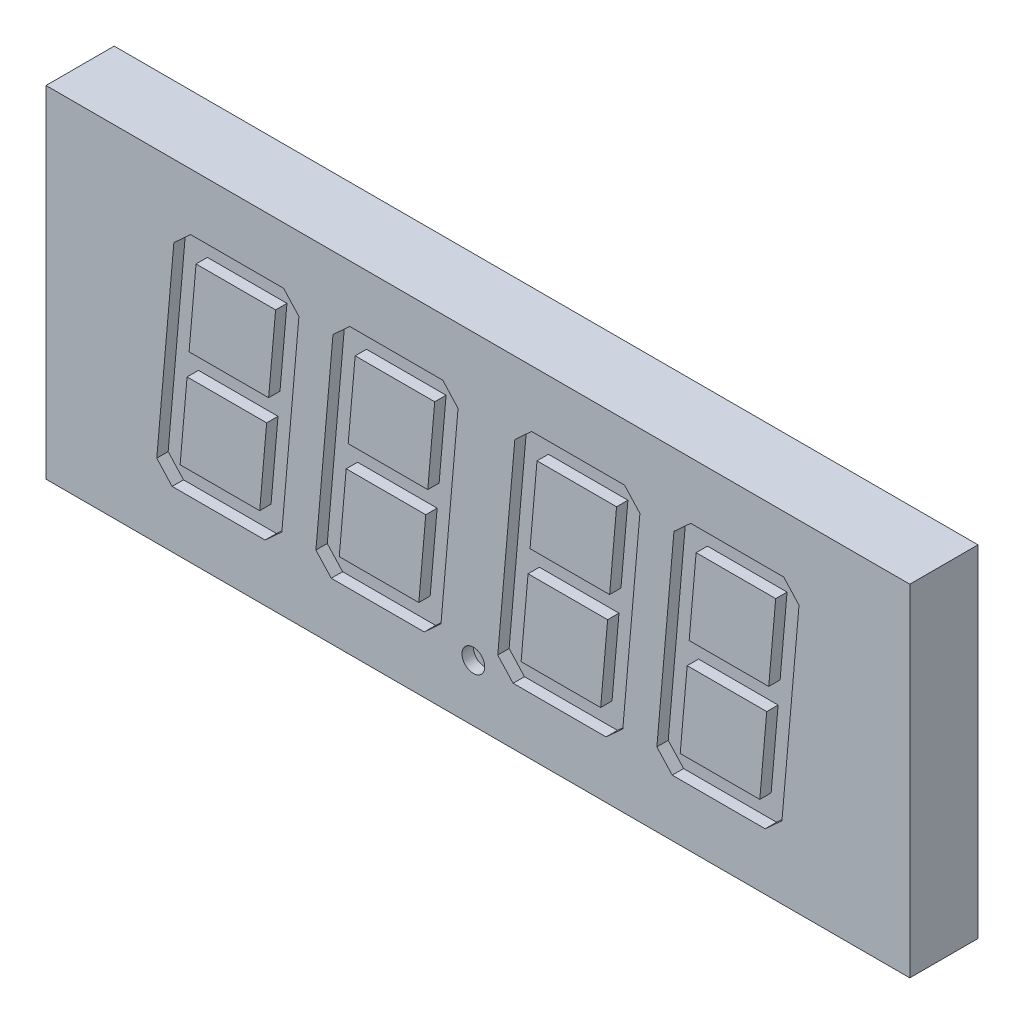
ISO-10303-21;
HEADER;
FILE_DESCRIPTION(('STEP AP214'),'2;1');
FILE_NAME('part.step','',(''),(''),'','','');
FILE_SCHEMA(('AUTOMOTIVE_DESIGN { 1 0 10303 214 1 1 1 1 }'));
ENDSEC;
DATA;
#1=APPLICATION_CONTEXT('core data for automotive mechanical design processes');
#2=APPLICATION_PROTOCOL_DEFINITION('international standard','automotive_design',2000,#1);
#3=PRODUCT_CONTEXT('',#1,'mechanical');
#4=PRODUCT('Part','Part','',(#3));
#5=PRODUCT_RELATED_PRODUCT_CATEGORY('part','',(#4));
#6=PRODUCT_DEFINITION_FORMATION('','',#4);
#7=PRODUCT_DEFINITION_CONTEXT('part definition',#1,'design');
#8=PRODUCT_DEFINITION('design','',#6,#7);
#9=PRODUCT_DEFINITION_SHAPE('','',#8);
#10=(LENGTH_UNIT() NAMED_UNIT(*) SI_UNIT(.MILLI.,.METRE.));
#11=(NAMED_UNIT(*) PLANE_ANGLE_UNIT() SI_UNIT($,.RADIAN.));
#12=(NAMED_UNIT(*) SI_UNIT($,.STERADIAN.) SOLID_ANGLE_UNIT());
#13=UNCERTAINTY_MEASURE_WITH_UNIT(LENGTH_MEASURE(1.E-05),#10,'distance_accuracy_value','');
#14=(GEOMETRIC_REPRESENTATION_CONTEXT(3) GLOBAL_UNCERTAINTY_ASSIGNED_CONTEXT((#13)) GLOBAL_UNIT_ASSIGNED_CONTEXT((#10,
#11,#12)) REPRESENTATION_CONTEXT('',''));
#15=CARTESIAN_POINT('',(0.,0.,0.));
#16=DIRECTION('',(0.,0.,1.));
#17=DIRECTION('',(1.,0.,0.));
#18=AXIS2_PLACEMENT_3D('',#15,#16,#17);
#19=CARTESIAN_POINT('',(-15.,-7.5,-3.));
#20=DIRECTION('',(-1.,0.,0.));
#21=DIRECTION('',(0.,-1.,0.));
#22=AXIS2_PLACEMENT_3D('',#19,#20,#21);
#23=PLANE('',#22);
#24=DIRECTION('',(0.,-1.,0.));
#25=VECTOR('',#24,1.);
#26=CARTESIAN_POINT('',(-15.,-7.5,0.));
#27=LINE('',#26,#25);
#28=CARTESIAN_POINT('',(-15.,7.5,0.));
#29=VERTEX_POINT('',#28);
#30=CARTESIAN_POINT('',(-15.,-7.5,0.));
#31=VERTEX_POINT('',#30);
#32=EDGE_CURVE('E1145',#29,#31,#27,.T.);
#33=ORIENTED_EDGE('',*,*,#32,.F.);
#34=DIRECTION('',(0.,0.,1.));
#35=VECTOR('',#34,1.);
#36=CARTESIAN_POINT('',(-15.,7.5,-3.));
#37=LINE('',#36,#35);
#38=CARTESIAN_POINT('',(-15.,7.5,-3.));
#39=VERTEX_POINT('',#38);
#40=EDGE_CURVE('E11',#39,#29,#37,.T.);
#41=ORIENTED_EDGE('',*,*,#40,.F.);
#42=DIRECTION('',(0.,-1.,0.));
#43=VECTOR('',#42,1.);
#44=CARTESIAN_POINT('',(-15.,-7.5,-3.));
#45=LINE('',#44,#43);
#46=CARTESIAN_POINT('',(-15.,-7.5,-3.));
#47=VERTEX_POINT('',#46);
#48=EDGE_CURVE('E1154',#39,#47,#45,.T.);
#49=ORIENTED_EDGE('',*,*,#48,.T.);
#50=DIRECTION('',(0.,0.,1.));
#51=VECTOR('',#50,1.);
#52=CARTESIAN_POINT('',(-15.,-7.5,-3.));
#53=LINE('',#52,#51);
#54=EDGE_CURVE('E44',#47,#31,#53,.T.);
#55=ORIENTED_EDGE('',*,*,#54,.T.);
#56=EDGE_LOOP('',(#33,#41,#49,#55));
#57=FACE_BOUND('',#56,.T.);
#58=ADVANCED_FACE('F41',(#57),#23,.T.);
#59=CARTESIAN_POINT('',(-15.,7.5,-3.));
#60=DIRECTION('',(0.,1.,0.));
#61=DIRECTION('',(0.,0.,1.));
#62=AXIS2_PLACEMENT_3D('',#59,#60,#61);
#63=PLANE('',#62);
#64=DIRECTION('',(-1.,0.,0.));
#65=VECTOR('',#64,1.);
#66=CARTESIAN_POINT('',(-15.,7.5,0.));
#67=LINE('',#66,#65);
#68=CARTESIAN_POINT('',(23.,7.5,0.));
#69=VERTEX_POINT('',#68);
#70=EDGE_CURVE('E1158',#69,#29,#67,.T.);
#71=ORIENTED_EDGE('',*,*,#70,.F.);
#72=DIRECTION('',(0.,0.,1.));
#73=VECTOR('',#72,1.);
#74=CARTESIAN_POINT('',(23.,7.5,-3.));
#75=LINE('',#74,#73);
#76=CARTESIAN_POINT('',(23.,7.5,-3.));
#77=VERTEX_POINT('',#76);
#78=EDGE_CURVE('E49',#77,#69,#75,.T.);
#79=ORIENTED_EDGE('',*,*,#78,.F.);
#80=DIRECTION('',(-1.,0.,0.));
#81=VECTOR('',#80,1.);
#82=CARTESIAN_POINT('',(-15.,7.5,-3.));
#83=LINE('',#82,#81);
#84=EDGE_CURVE('E1165',#77,#39,#83,.T.);
#85=ORIENTED_EDGE('',*,*,#84,.T.);
#86=ORIENTED_EDGE('',*,*,#40,.T.);
#87=EDGE_LOOP('',(#71,#79,#85,#86));
#88=FACE_BOUND('',#87,.T.);
#89=ADVANCED_FACE('F1194',(#88),#63,.T.);
#90=CARTESIAN_POINT('',(23.,-7.5,-3.));
#91=DIRECTION('',(1.,0.,0.));
#92=DIRECTION('',(0.,0.,-1.));
#93=AXIS2_PLACEMENT_3D('',#90,#91,#92);
#94=PLANE('',#93);
#95=DIRECTION('',(0.,1.,0.));
#96=VECTOR('',#95,1.);
#97=CARTESIAN_POINT('',(23.,-7.5,0.));
#98=LINE('',#97,#96);
#99=CARTESIAN_POINT('',(23.,-7.5,0.));
#100=VERTEX_POINT('',#99);
#101=EDGE_CURVE('E1174',#100,#69,#98,.T.);
#102=ORIENTED_EDGE('',*,*,#101,.F.);
#103=DIRECTION('',(0.,0.,1.));
#104=VECTOR('',#103,1.);
#105=CARTESIAN_POINT('',(23.,-7.5,-3.));
#106=LINE('',#105,#104);
#107=CARTESIAN_POINT('',(23.,-7.5,-3.));
#108=VERTEX_POINT('',#107);
#109=EDGE_CURVE('E1180',#108,#100,#106,.T.);
#110=ORIENTED_EDGE('',*,*,#109,.F.);
#111=DIRECTION('',(0.,1.,0.));
#112=VECTOR('',#111,1.);
#113=CARTESIAN_POINT('',(23.,-7.5,-3.));
#114=LINE('',#113,#112);
#115=EDGE_CURVE('E1162',#108,#77,#114,.T.);
#116=ORIENTED_EDGE('',*,*,#115,.T.);
#117=ORIENTED_EDGE('',*,*,#78,.T.);
#118=EDGE_LOOP('',(#102,#110,#116,#117));
#119=FACE_BOUND('',#118,.T.);
#120=ADVANCED_FACE('F1200',(#119),#94,.T.);
#121=CARTESIAN_POINT('',(-15.,-7.5,-3.));
#122=DIRECTION('',(0.,-1.,0.));
#123=DIRECTION('',(0.,0.,-1.));
#124=AXIS2_PLACEMENT_3D('',#121,#122,#123);
#125=PLANE('',#124);
#126=DIRECTION('',(1.,0.,0.));
#127=VECTOR('',#126,1.);
#128=CARTESIAN_POINT('',(-15.,-7.5,0.));
#129=LINE('',#128,#127);
#130=EDGE_CURVE('E1170',#31,#100,#129,.T.);
#131=ORIENTED_EDGE('',*,*,#130,.F.);
#132=ORIENTED_EDGE('',*,*,#54,.F.);
#133=DIRECTION('',(1.,0.,0.));
#134=VECTOR('',#133,1.);
#135=CARTESIAN_POINT('',(-15.,-7.5,-3.));
#136=LINE('',#135,#134);
#137=EDGE_CURVE('E1157',#47,#108,#136,.T.);
#138=ORIENTED_EDGE('',*,*,#137,.T.);
#139=ORIENTED_EDGE('',*,*,#109,.T.);
#140=EDGE_LOOP('',(#131,#132,#138,#139));
#141=FACE_BOUND('',#140,.T.);
#142=ADVANCED_FACE('F1189',(#141),#125,.T.);
#143=CARTESIAN_POINT('',(0.,0.,-3.));
#144=DIRECTION('',(0.,0.,-1.));
#145=DIRECTION('',(-1.,0.,0.));
#146=AXIS2_PLACEMENT_3D('',#143,#144,#145);
#147=PLANE('',#146);
#148=ORIENTED_EDGE('',*,*,#48,.F.);
#149=ORIENTED_EDGE('',*,*,#84,.F.);
#150=ORIENTED_EDGE('',*,*,#115,.F.);
#151=ORIENTED_EDGE('',*,*,#137,.F.);
#152=EDGE_LOOP('',(#148,#149,#150,#151));
#153=FACE_BOUND('',#152,.T.);
#154=ADVANCED_FACE('F1197',(#153),#147,.T.);
#155=CARTESIAN_POINT('',(0.,0.,0.));
#156=DIRECTION('',(0.,0.,-1.));
#157=DIRECTION('',(-1.,0.,0.));
#158=AXIS2_PLACEMENT_3D('',#155,#156,#157);
#159=PLANE('',#158);
#160=CARTESIAN_POINT('',(3.8,-5.,0.));
#161=DIRECTION('',(0.,0.,1.));
#162=DIRECTION('',(1.,0.,0.));
#163=AXIS2_PLACEMENT_3D('',#160,#161,#162);
#164=CIRCLE('',#163,0.5);
#165=CARTESIAN_POINT('',(4.3,-5.,0.));
#166=VERTEX_POINT('',#165);
#167=EDGE_CURVE('E556',#166,#166,#164,.T.);
#168=ORIENTED_EDGE('',*,*,#167,.F.);
#169=EDGE_LOOP('',(#168));
#170=FACE_BOUND('',#169,.T.);
#171=DIRECTION('',(-0.675590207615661,0.737277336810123,0.));
#172=VECTOR('',#171,1.);
#173=CARTESIAN_POINT('',(17.4511695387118,5.,0.));
#174=LINE('',#173,#172);
#175=CARTESIAN_POINT('',(18.1267597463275,4.26272266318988,0.));
#176=VERTEX_POINT('',#175);
#177=CARTESIAN_POINT('',(17.4511695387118,5.,0.));
#178=VERTEX_POINT('',#177);
#179=EDGE_CURVE('E569',#176,#178,#174,.T.);
#180=ORIENTED_EDGE('',*,*,#179,.F.);
#181=DIRECTION('',(0.0871557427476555,0.996194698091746,0.));
#182=VECTOR('',#181,1.);
#183=CARTESIAN_POINT('',(17.7538198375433,0.,0.));
#184=LINE('',#183,#182);
#185=CARTESIAN_POINT('',(17.3754830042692,-4.32440979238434,0.));
#186=VERTEX_POINT('',#185);
#187=EDGE_CURVE('E674',#186,#176,#184,.T.);
#188=ORIENTED_EDGE('',*,*,#187,.F.);
#189=DIRECTION('',(0.737277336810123,0.675590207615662,0.));
#190=VECTOR('',#189,1.);
#191=CARTESIAN_POINT('',(17.3754830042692,-4.32440979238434,0.));
#192=LINE('',#191,#190);
#193=CARTESIAN_POINT('',(16.6382056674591,-5.,0.));
#194=VERTEX_POINT('',#193);
#195=EDGE_CURVE('E670',#194,#186,#192,.T.);
#196=ORIENTED_EDGE('',*,*,#195,.F.);
#197=DIRECTION('',(1.,0.,0.));
#198=VECTOR('',#197,1.);
#199=CARTESIAN_POINT('',(16.6382056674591,-5.,0.));
#200=LINE('',#199,#198);
#201=CARTESIAN_POINT('',(12.5488304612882,-5.,0.));
#202=VERTEX_POINT('',#201);
#203=EDGE_CURVE('E666',#202,#194,#200,.T.);
#204=ORIENTED_EDGE('',*,*,#203,.F.);
#205=DIRECTION('',(0.675590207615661,-0.737277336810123,0.));
#206=VECTOR('',#205,1.);
#207=CARTESIAN_POINT('',(12.5488304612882,-5.,0.));
#208=LINE('',#207,#206);
#209=CARTESIAN_POINT('',(11.8732402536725,-4.26272266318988,0.));
#210=VERTEX_POINT('',#209);
#211=EDGE_CURVE('E68',#210,#202,#208,.T.);
#212=ORIENTED_EDGE('',*,*,#211,.F.);
#213=DIRECTION('',(-0.0871557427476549,-0.996194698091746,0.));
#214=VECTOR('',#213,1.);
#215=CARTESIAN_POINT('',(11.8732402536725,-4.26272266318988,0.));
#216=LINE('',#215,#214);
#217=CARTESIAN_POINT('',(12.6245169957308,4.32440979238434,0.));
#218=VERTEX_POINT('',#217);
#219=EDGE_CURVE('E648',#218,#210,#216,.T.);
#220=ORIENTED_EDGE('',*,*,#219,.F.);
#221=DIRECTION('',(-0.737277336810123,-0.675590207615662,0.));
#222=VECTOR('',#221,1.);
#223=CARTESIAN_POINT('',(12.6245169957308,4.32440979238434,0.));
#224=LINE('',#223,#222);
#225=CARTESIAN_POINT('',(13.3617943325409,5.,0.));
#226=VERTEX_POINT('',#225);
#227=EDGE_CURVE('E577',#226,#218,#224,.T.);
#228=ORIENTED_EDGE('',*,*,#227,.F.);
#229=DIRECTION('',(-1.,0.,0.));
#230=VECTOR('',#229,1.);
#231=CARTESIAN_POINT('',(13.3617943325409,5.,0.));
#232=LINE('',#231,#230);
#233=EDGE_CURVE('E586',#178,#226,#232,.T.);
#234=ORIENTED_EDGE('',*,*,#233,.F.);
#235=EDGE_LOOP('',(#180,#188,#196,#204,#212,#220,#228,#234));
#236=FACE_BOUND('',#235,.T.);
#237=DIRECTION('',(-0.675590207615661,0.737277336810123,0.));
#238=VECTOR('',#237,1.);
#239=CARTESIAN_POINT('',(10.4511695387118,5.,0.));
#240=LINE('',#239,#238);
#241=CARTESIAN_POINT('',(11.1267597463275,4.26272266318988,0.));
#242=VERTEX_POINT('',#241);
#243=CARTESIAN_POINT('',(10.4511695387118,5.,0.));
#244=VERTEX_POINT('',#243);
#245=EDGE_CURVE('E722',#242,#244,#240,.T.);
#246=ORIENTED_EDGE('',*,*,#245,.F.);
#247=DIRECTION('',(0.0871557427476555,0.996194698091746,0.));
#248=VECTOR('',#247,1.);
#249=CARTESIAN_POINT('',(10.7538198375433,0.,0.));
#250=LINE('',#249,#248);
#251=CARTESIAN_POINT('',(10.3754830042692,-4.32440979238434,0.));
#252=VERTEX_POINT('',#251);
#253=EDGE_CURVE('E833',#252,#242,#250,.T.);
#254=ORIENTED_EDGE('',*,*,#253,.F.);
#255=DIRECTION('',(0.737277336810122,0.675590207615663,0.));
#256=VECTOR('',#255,1.);
#257=CARTESIAN_POINT('',(10.3754830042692,-4.32440979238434,0.));
#258=LINE('',#257,#256);
#259=CARTESIAN_POINT('',(9.63820566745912,-5.,0.));
#260=VERTEX_POINT('',#259);
#261=EDGE_CURVE('E829',#260,#252,#258,.T.);
#262=ORIENTED_EDGE('',*,*,#261,.F.);
#263=DIRECTION('',(1.,0.,0.));
#264=VECTOR('',#263,1.);
#265=CARTESIAN_POINT('',(9.63820566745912,-5.,0.));
#266=LINE('',#265,#264);
#267=CARTESIAN_POINT('',(5.54883046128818,-5.,0.));
#268=VERTEX_POINT('',#267);
#269=EDGE_CURVE('E825',#268,#260,#266,.T.);
#270=ORIENTED_EDGE('',*,*,#269,.F.);
#271=DIRECTION('',(0.675590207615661,-0.737277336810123,0.));
#272=VECTOR('',#271,1.);
#273=CARTESIAN_POINT('',(5.54883046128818,-5.,0.));
#274=LINE('',#273,#272);
#275=CARTESIAN_POINT('',(4.87324025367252,-4.26272266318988,0.));
#276=VERTEX_POINT('',#275);
#277=EDGE_CURVE('E794',#276,#268,#274,.T.);
#278=ORIENTED_EDGE('',*,*,#277,.F.);
#279=DIRECTION('',(-0.0871557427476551,-0.996194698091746,0.));
#280=VECTOR('',#279,1.);
#281=CARTESIAN_POINT('',(4.87324025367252,-4.26272266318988,0.));
#282=LINE('',#281,#280);
#283=CARTESIAN_POINT('',(5.62451699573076,4.32440979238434,0.));
#284=VERTEX_POINT('',#283);
#285=EDGE_CURVE('E807',#284,#276,#282,.T.);
#286=ORIENTED_EDGE('',*,*,#285,.F.);
#287=DIRECTION('',(-0.737277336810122,-0.675590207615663,0.));
#288=VECTOR('',#287,1.);
#289=CARTESIAN_POINT('',(5.62451699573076,4.32440979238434,0.));
#290=LINE('',#289,#288);
#291=CARTESIAN_POINT('',(6.36179433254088,5.,0.));
#292=VERTEX_POINT('',#291);
#293=EDGE_CURVE('E734',#292,#284,#290,.T.);
#294=ORIENTED_EDGE('',*,*,#293,.F.);
#295=DIRECTION('',(-1.,0.,0.));
#296=VECTOR('',#295,1.);
#297=CARTESIAN_POINT('',(6.36179433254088,5.,0.));
#298=LINE('',#297,#296);
#299=EDGE_CURVE('E745',#244,#292,#298,.T.);
#300=ORIENTED_EDGE('',*,*,#299,.F.);
#301=EDGE_LOOP('',(#246,#254,#262,#270,#278,#286,#294,#300));
#302=FACE_BOUND('',#301,.T.);
#303=DIRECTION('',(-0.675590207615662,0.737277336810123,0.));
#304=VECTOR('',#303,1.);
#305=CARTESIAN_POINT('',(2.45116953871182,5.,0.));
#306=LINE('',#305,#304);
#307=CARTESIAN_POINT('',(3.12675974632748,4.26272266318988,0.));
#308=VERTEX_POINT('',#307);
#309=CARTESIAN_POINT('',(2.45116953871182,5.,0.));
#310=VERTEX_POINT('',#309);
#311=EDGE_CURVE('E885',#308,#310,#306,.T.);
#312=ORIENTED_EDGE('',*,*,#311,.F.);
#313=DIRECTION('',(0.0871557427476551,0.996194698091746,0.));
#314=VECTOR('',#313,1.);
#315=CARTESIAN_POINT('',(2.75381983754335,0.,0.));
#316=LINE('',#315,#314);
#317=CARTESIAN_POINT('',(2.37548300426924,-4.32440979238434,0.));
#318=VERTEX_POINT('',#317);
#319=EDGE_CURVE('E997',#318,#308,#316,.T.);
#320=ORIENTED_EDGE('',*,*,#319,.F.);
#321=DIRECTION('',(0.737277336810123,0.675590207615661,0.));
#322=VECTOR('',#321,1.);
#323=CARTESIAN_POINT('',(2.37548300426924,-4.32440979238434,0.));
#324=LINE('',#323,#322);
#325=CARTESIAN_POINT('',(1.63820566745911,-5.,0.));
#326=VERTEX_POINT('',#325);
#327=EDGE_CURVE('E993',#326,#318,#324,.T.);
#328=ORIENTED_EDGE('',*,*,#327,.F.);
#329=DIRECTION('',(1.,0.,0.));
#330=VECTOR('',#329,1.);
#331=CARTESIAN_POINT('',(1.63820566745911,-5.,0.));
#332=LINE('',#331,#330);
#333=CARTESIAN_POINT('',(-2.45116953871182,-5.,0.));
#334=VERTEX_POINT('',#333);
#335=EDGE_CURVE('E989',#334,#326,#332,.T.);
#336=ORIENTED_EDGE('',*,*,#335,.F.);
#337=DIRECTION('',(0.675590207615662,-0.737277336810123,0.));
#338=VECTOR('',#337,1.);
#339=CARTESIAN_POINT('',(-2.45116953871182,-5.,0.));
#340=LINE('',#339,#338);
#341=CARTESIAN_POINT('',(-3.12675974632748,-4.26272266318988,0.));
#342=VERTEX_POINT('',#341);
#343=EDGE_CURVE('E956',#342,#334,#340,.T.);
#344=ORIENTED_EDGE('',*,*,#343,.F.);
#345=DIRECTION('',(-0.0871557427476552,-0.996194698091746,0.));
#346=VECTOR('',#345,1.);
#347=CARTESIAN_POINT('',(-3.12675974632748,-4.26272266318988,0.));
#348=LINE('',#347,#346);
#349=CARTESIAN_POINT('',(-2.37548300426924,4.32440979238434,0.));
#350=VERTEX_POINT('',#349);
#351=EDGE_CURVE('E971',#350,#342,#348,.T.);
#352=ORIENTED_EDGE('',*,*,#351,.F.);
#353=DIRECTION('',(-0.737277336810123,-0.675590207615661,0.));
#354=VECTOR('',#353,1.);
#355=CARTESIAN_POINT('',(-2.37548300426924,4.32440979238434,0.));
#356=LINE('',#355,#354);
#357=CARTESIAN_POINT('',(-1.63820566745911,5.,0.));
#358=VERTEX_POINT('',#357);
#359=EDGE_CURVE('E897',#358,#350,#356,.T.);
#360=ORIENTED_EDGE('',*,*,#359,.F.);
#361=DIRECTION('',(-1.,0.,0.));
#362=VECTOR('',#361,1.);
#363=CARTESIAN_POINT('',(-1.63820566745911,5.,0.));
#364=LINE('',#363,#362);
#365=EDGE_CURVE('E906',#310,#358,#364,.T.);
#366=ORIENTED_EDGE('',*,*,#365,.F.);
#367=EDGE_LOOP('',(#312,#320,#328,#336,#344,#352,#360,#366));
#368=FACE_BOUND('',#367,.T.);
#369=DIRECTION('',(-0.675590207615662,0.737277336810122,0.));
#370=VECTOR('',#369,1.);
#371=CARTESIAN_POINT('',(-4.54883046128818,5.,0.));
#372=LINE('',#371,#370);
#373=CARTESIAN_POINT('',(-3.87324025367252,4.26272266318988,0.));
#374=VERTEX_POINT('',#373);
#375=CARTESIAN_POINT('',(-4.54883046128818,5.,0.));
#376=VERTEX_POINT('',#375);
#377=EDGE_CURVE('E1042',#374,#376,#372,.T.);
#378=ORIENTED_EDGE('',*,*,#377,.F.);
#379=DIRECTION('',(0.0871557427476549,0.996194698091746,0.));
#380=VECTOR('',#379,1.);
#381=CARTESIAN_POINT('',(-4.24618016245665,0.,0.));
#382=LINE('',#381,#380);
#383=CARTESIAN_POINT('',(-4.62451699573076,-4.32440979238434,0.));
#384=VERTEX_POINT('',#383);
#385=EDGE_CURVE('E1138',#384,#374,#382,.T.);
#386=ORIENTED_EDGE('',*,*,#385,.F.);
#387=DIRECTION('',(0.737277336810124,0.675590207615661,0.));
#388=VECTOR('',#387,1.);
#389=CARTESIAN_POINT('',(-4.62451699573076,-4.32440979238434,0.));
#390=LINE('',#389,#388);
#391=CARTESIAN_POINT('',(-5.36179433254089,-5.,0.));
#392=VERTEX_POINT('',#391);
#393=EDGE_CURVE('E1134',#392,#384,#390,.T.);
#394=ORIENTED_EDGE('',*,*,#393,.F.);
#395=DIRECTION('',(1.,0.,0.));
#396=VECTOR('',#395,1.);
#397=CARTESIAN_POINT('',(-5.36179433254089,-5.,0.));
#398=LINE('',#397,#396);
#399=CARTESIAN_POINT('',(-9.45116953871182,-5.,0.));
#400=VERTEX_POINT('',#399);
#401=EDGE_CURVE('E1130',#400,#392,#398,.T.);
#402=ORIENTED_EDGE('',*,*,#401,.F.);
#403=DIRECTION('',(0.675590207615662,-0.737277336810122,0.));
#404=VECTOR('',#403,1.);
#405=CARTESIAN_POINT('',(-9.45116953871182,-5.,0.));
#406=LINE('',#405,#404);
#407=CARTESIAN_POINT('',(-10.1267597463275,-4.26272266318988,0.));
#408=VERTEX_POINT('',#407);
#409=EDGE_CURVE('E1103',#408,#400,#406,.T.);
#410=ORIENTED_EDGE('',*,*,#409,.F.);
#411=DIRECTION('',(-0.0871557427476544,-0.996194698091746,0.));
#412=VECTOR('',#411,1.);
#413=CARTESIAN_POINT('',(-10.1267597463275,-4.26272266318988,0.));
#414=LINE('',#413,#412);
#415=CARTESIAN_POINT('',(-9.37548300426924,4.32440979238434,0.));
#416=VERTEX_POINT('',#415);
#417=EDGE_CURVE('E1114',#416,#408,#414,.T.);
#418=ORIENTED_EDGE('',*,*,#417,.F.);
#419=DIRECTION('',(-0.737277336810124,-0.675590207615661,0.));
#420=VECTOR('',#419,1.);
#421=CARTESIAN_POINT('',(-9.37548300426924,4.32440979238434,0.));
#422=LINE('',#421,#420);
#423=CARTESIAN_POINT('',(-8.63820566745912,5.,0.));
#424=VERTEX_POINT('',#423);
#425=EDGE_CURVE('E1053',#424,#416,#422,.T.);
#426=ORIENTED_EDGE('',*,*,#425,.F.);
#427=DIRECTION('',(-1.,0.,0.));
#428=VECTOR('',#427,1.);
#429=CARTESIAN_POINT('',(-8.63820566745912,5.,0.));
#430=LINE('',#429,#428);
#431=EDGE_CURVE('E1062',#376,#424,#430,.T.);
#432=ORIENTED_EDGE('',*,*,#431,.F.);
#433=EDGE_LOOP('',(#378,#386,#394,#402,#410,#418,#426,#432));
#434=FACE_BOUND('',#433,.T.);
#435=ORIENTED_EDGE('',*,*,#32,.T.);
#436=ORIENTED_EDGE('',*,*,#130,.T.);
#437=ORIENTED_EDGE('',*,*,#101,.T.);
#438=ORIENTED_EDGE('',*,*,#70,.T.);
#439=EDGE_LOOP('',(#435,#436,#437,#438));
#440=FACE_BOUND('',#439,.T.);
#441=ADVANCED_FACE('F1191',(#170,#236,#302,#368,#434,#440),#159,.F.);
#442=CARTESIAN_POINT('',(-9.45116953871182,-5.,-0.5));
#443=DIRECTION('',(-0.737277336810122,-0.675590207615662,0.));
#444=DIRECTION('',(0.675590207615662,-0.737277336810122,0.));
#445=AXIS2_PLACEMENT_3D('',#442,#443,#444);
#446=PLANE('',#445);
#447=ORIENTED_EDGE('',*,*,#409,.T.);
#448=DIRECTION('',(0.,0.,1.));
#449=VECTOR('',#448,1.);
#450=CARTESIAN_POINT('',(-9.45116953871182,-5.,-0.5));
#451=LINE('',#450,#449);
#452=CARTESIAN_POINT('',(-9.45116953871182,-5.,-0.5));
#453=VERTEX_POINT('',#452);
#454=EDGE_CURVE('E1128',#453,#400,#451,.T.);
#455=ORIENTED_EDGE('',*,*,#454,.F.);
#456=DIRECTION('',(0.675590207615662,-0.737277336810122,0.));
#457=VECTOR('',#456,1.);
#458=CARTESIAN_POINT('',(-9.45116953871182,-5.,-0.5));
#459=LINE('',#458,#457);
#460=CARTESIAN_POINT('',(-10.1267597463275,-4.26272266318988,-0.5));
#461=VERTEX_POINT('',#460);
#462=EDGE_CURVE('E1110',#461,#453,#459,.T.);
#463=ORIENTED_EDGE('',*,*,#462,.F.);
#464=DIRECTION('',(0.,0.,1.));
#465=VECTOR('',#464,1.);
#466=CARTESIAN_POINT('',(-10.1267597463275,-4.26272266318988,-0.5));
#467=LINE('',#466,#465);
#468=EDGE_CURVE('E1143',#461,#408,#467,.T.);
#469=ORIENTED_EDGE('',*,*,#468,.T.);
#470=EDGE_LOOP('',(#447,#455,#463,#469));
#471=FACE_BOUND('',#470,.T.);
#472=ADVANCED_FACE('F1242',(#471),#446,.F.);
#473=CARTESIAN_POINT('',(-10.1267597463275,-4.26272266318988,-0.5));
#474=DIRECTION('',(-0.996194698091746,0.0871557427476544,0.));
#475=DIRECTION('',(-0.0871557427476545,-0.996194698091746,0.));
#476=AXIS2_PLACEMENT_3D('',#473,#474,#475);
#477=PLANE('',#476);
#478=ORIENTED_EDGE('',*,*,#417,.T.);
#479=ORIENTED_EDGE('',*,*,#468,.F.);
#480=DIRECTION('',(-0.0871557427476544,-0.996194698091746,0.));
#481=VECTOR('',#480,1.);
#482=CARTESIAN_POINT('',(-10.1267597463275,-4.26272266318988,-0.5));
#483=LINE('',#482,#481);
#484=CARTESIAN_POINT('',(-9.37548300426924,4.32440979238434,-0.5));
#485=VERTEX_POINT('',#484);
#486=EDGE_CURVE('E1125',#485,#461,#483,.T.);
#487=ORIENTED_EDGE('',*,*,#486,.F.);
#488=DIRECTION('',(0.,0.,1.));
#489=VECTOR('',#488,1.);
#490=CARTESIAN_POINT('',(-9.37548300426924,4.32440979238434,-0.5));
#491=LINE('',#490,#489);
#492=EDGE_CURVE('E1071',#485,#416,#491,.T.);
#493=ORIENTED_EDGE('',*,*,#492,.T.);
#494=EDGE_LOOP('',(#478,#479,#487,#493));
#495=FACE_BOUND('',#494,.T.);
#496=ADVANCED_FACE('F1247',(#495),#477,.F.);
#497=CARTESIAN_POINT('',(-4.24618016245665,0.,-0.5));
#498=DIRECTION('',(0.996194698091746,-0.0871557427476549,0.));
#499=DIRECTION('',(0.0871557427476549,0.996194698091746,0.));
#500=AXIS2_PLACEMENT_3D('',#497,#498,#499);
#501=PLANE('',#500);
#502=ORIENTED_EDGE('',*,*,#385,.T.);
#503=DIRECTION('',(0.,0.,1.));
#504=VECTOR('',#503,1.);
#505=CARTESIAN_POINT('',(-3.87324025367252,4.26272266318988,-0.5));
#506=LINE('',#505,#504);
#507=CARTESIAN_POINT('',(-3.87324025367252,4.26272266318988,-0.5));
#508=VERTEX_POINT('',#507);
#509=EDGE_CURVE('E1067',#508,#374,#506,.T.);
#510=ORIENTED_EDGE('',*,*,#509,.F.);
#511=DIRECTION('',(0.0871557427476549,0.996194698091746,0.));
#512=VECTOR('',#511,1.);
#513=CARTESIAN_POINT('',(-4.24618016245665,0.,-0.5));
#514=LINE('',#513,#512);
#515=CARTESIAN_POINT('',(-4.62451699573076,-4.32440979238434,-0.5));
#516=VERTEX_POINT('',#515);
#517=EDGE_CURVE('E1122',#516,#508,#514,.T.);
#518=ORIENTED_EDGE('',*,*,#517,.F.);
#519=DIRECTION('',(0.,0.,1.));
#520=VECTOR('',#519,1.);
#521=CARTESIAN_POINT('',(-4.62451699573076,-4.32440979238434,-0.5));
#522=LINE('',#521,#520);
#523=EDGE_CURVE('E1146',#516,#384,#522,.T.);
#524=ORIENTED_EDGE('',*,*,#523,.T.);
#525=EDGE_LOOP('',(#502,#510,#518,#524));
#526=FACE_BOUND('',#525,.T.);
#527=ADVANCED_FACE('F1263',(#526),#501,.F.);
#528=CARTESIAN_POINT('',(-4.62451699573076,-4.32440979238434,-0.5));
#529=DIRECTION('',(0.675590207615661,-0.737277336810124,0.));
#530=DIRECTION('',(0.737277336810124,0.675590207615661,0.));
#531=AXIS2_PLACEMENT_3D('',#528,#529,#530);
#532=PLANE('',#531);
#533=ORIENTED_EDGE('',*,*,#393,.T.);
#534=ORIENTED_EDGE('',*,*,#523,.F.);
#535=DIRECTION('',(0.737277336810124,0.675590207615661,0.));
#536=VECTOR('',#535,1.);
#537=CARTESIAN_POINT('',(-4.62451699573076,-4.32440979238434,-0.5));
#538=LINE('',#537,#536);
#539=CARTESIAN_POINT('',(-5.36179433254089,-5.,-0.5));
#540=VERTEX_POINT('',#539);
#541=EDGE_CURVE('E1118',#540,#516,#538,.T.);
#542=ORIENTED_EDGE('',*,*,#541,.F.);
#543=DIRECTION('',(0.,0.,1.));
#544=VECTOR('',#543,1.);
#545=CARTESIAN_POINT('',(-5.36179433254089,-5.,-0.5));
#546=LINE('',#545,#544);
#547=EDGE_CURVE('E1149',#540,#392,#546,.T.);
#548=ORIENTED_EDGE('',*,*,#547,.T.);
#549=EDGE_LOOP('',(#533,#534,#542,#548));
#550=FACE_BOUND('',#549,.T.);
#551=ADVANCED_FACE('F1257',(#550),#532,.F.);
#552=CARTESIAN_POINT('',(-5.36179433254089,-5.,-0.5));
#553=DIRECTION('',(0.,-1.,0.));
#554=DIRECTION('',(1.,0.,0.));
#555=AXIS2_PLACEMENT_3D('',#552,#553,#554);
#556=PLANE('',#555);
#557=ORIENTED_EDGE('',*,*,#401,.T.);
#558=ORIENTED_EDGE('',*,*,#547,.F.);
#559=DIRECTION('',(1.,0.,0.));
#560=VECTOR('',#559,1.);
#561=CARTESIAN_POINT('',(-5.36179433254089,-5.,-0.5));
#562=LINE('',#561,#560);
#563=EDGE_CURVE('E1113',#453,#540,#562,.T.);
#564=ORIENTED_EDGE('',*,*,#563,.F.);
#565=ORIENTED_EDGE('',*,*,#454,.T.);
#566=EDGE_LOOP('',(#557,#558,#564,#565));
#567=FACE_BOUND('',#566,.T.);
#568=ADVANCED_FACE('F1262',(#567),#556,.F.);
#569=CARTESIAN_POINT('',(0.,0.,-0.5));
#570=DIRECTION('',(0.,0.,1.));
#571=DIRECTION('',(1.,0.,0.));
#572=AXIS2_PLACEMENT_3D('',#569,#570,#571);
#573=PLANE('',#572);
#574=DIRECTION('',(-1.,0.,0.));
#575=VECTOR('',#574,1.);
#576=CARTESIAN_POINT('',(-8.79374433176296,-0.499999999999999,-0.5));
#577=LINE('',#576,#575);
#578=CARTESIAN_POINT('',(-5.29374433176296,-0.499999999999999,-0.5));
#579=VERTEX_POINT('',#578);
#580=CARTESIAN_POINT('',(-8.79374433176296,-0.499999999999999,-0.5));
#581=VERTEX_POINT('',#580);
#582=EDGE_CURVE('E1087',#579,#581,#577,.T.);
#583=ORIENTED_EDGE('',*,*,#582,.F.);
#584=DIRECTION('',(0.087155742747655,0.996194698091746,0.));
#585=VECTOR('',#584,1.);
#586=CARTESIAN_POINT('',(-5.29374433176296,-0.499999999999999,-0.5));
#587=LINE('',#586,#585);
#588=CARTESIAN_POINT('',(-5.59995465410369,-4.,-0.5));
#589=VERTEX_POINT('',#588);
#590=EDGE_CURVE('E1084',#589,#579,#587,.T.);
#591=ORIENTED_EDGE('',*,*,#590,.F.);
#592=DIRECTION('',(1.,0.,0.));
#593=VECTOR('',#592,1.);
#594=CARTESIAN_POINT('',(-5.59995465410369,-4.,-0.5));
#595=LINE('',#594,#593);
#596=CARTESIAN_POINT('',(-9.09995465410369,-4.,-0.5));
#597=VERTEX_POINT('',#596);
#598=EDGE_CURVE('E1080',#597,#589,#595,.T.);
#599=ORIENTED_EDGE('',*,*,#598,.F.);
#600=DIRECTION('',(-0.0871557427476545,-0.996194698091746,0.));
#601=VECTOR('',#600,1.);
#602=CARTESIAN_POINT('',(-9.09995465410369,-4.,-0.5));
#603=LINE('',#602,#601);
#604=EDGE_CURVE('E1077',#581,#597,#603,.T.);
#605=ORIENTED_EDGE('',*,*,#604,.F.);
#606=EDGE_LOOP('',(#583,#591,#599,#605));
#607=FACE_BOUND('',#606,.T.);
#608=ORIENTED_EDGE('',*,*,#462,.T.);
#609=ORIENTED_EDGE('',*,*,#563,.T.);
#610=ORIENTED_EDGE('',*,*,#541,.T.);
#611=ORIENTED_EDGE('',*,*,#517,.T.);
#612=DIRECTION('',(-0.675590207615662,0.737277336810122,0.));
#613=VECTOR('',#612,1.);
#614=CARTESIAN_POINT('',(-4.54883046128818,5.,-0.5));
#615=LINE('',#614,#613);
#616=CARTESIAN_POINT('',(-4.54883046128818,5.,-0.5));
#617=VERTEX_POINT('',#616);
#618=EDGE_CURVE('E1049',#508,#617,#615,.T.);
#619=ORIENTED_EDGE('',*,*,#618,.T.);
#620=DIRECTION('',(-1.,0.,0.));
#621=VECTOR('',#620,1.);
#622=CARTESIAN_POINT('',(-8.63820566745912,5.,-0.5));
#623=LINE('',#622,#621);
#624=CARTESIAN_POINT('',(-8.63820566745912,5.,-0.5));
#625=VERTEX_POINT('',#624);
#626=EDGE_CURVE('E1052',#617,#625,#623,.T.);
#627=ORIENTED_EDGE('',*,*,#626,.T.);
#628=DIRECTION('',(-0.737277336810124,-0.675590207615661,0.));
#629=VECTOR('',#628,1.);
#630=CARTESIAN_POINT('',(-9.37548300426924,4.32440979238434,-0.5));
#631=LINE('',#630,#629);
#632=EDGE_CURVE('E1056',#625,#485,#631,.T.);
#633=ORIENTED_EDGE('',*,*,#632,.T.);
#634=ORIENTED_EDGE('',*,*,#486,.T.);
#635=EDGE_LOOP('',(#608,#609,#610,#611,#619,#627,#633,#634));
#636=FACE_BOUND('',#635,.T.);
#637=DIRECTION('',(1.,0.,0.));
#638=VECTOR('',#637,1.);
#639=CARTESIAN_POINT('',(-5.20625566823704,0.499999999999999,-0.5));
#640=LINE('',#639,#638);
#641=CARTESIAN_POINT('',(-8.70625566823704,0.499999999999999,-0.5));
#642=VERTEX_POINT('',#641);
#643=CARTESIAN_POINT('',(-5.20625566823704,0.499999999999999,-0.5));
#644=VERTEX_POINT('',#643);
#645=EDGE_CURVE('E1026',#642,#644,#640,.T.);
#646=ORIENTED_EDGE('',*,*,#645,.F.);
#647=DIRECTION('',(-0.087155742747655,-0.996194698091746,0.));
#648=VECTOR('',#647,1.);
#649=CARTESIAN_POINT('',(-8.70625566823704,0.499999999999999,-0.5));
#650=LINE('',#649,#648);
#651=CARTESIAN_POINT('',(-8.40004534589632,4.,-0.5));
#652=VERTEX_POINT('',#651);
#653=EDGE_CURVE('E1023',#652,#642,#650,.T.);
#654=ORIENTED_EDGE('',*,*,#653,.F.);
#655=DIRECTION('',(-1.,0.,0.));
#656=VECTOR('',#655,1.);
#657=CARTESIAN_POINT('',(-8.40004534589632,4.,-0.5));
#658=LINE('',#657,#656);
#659=CARTESIAN_POINT('',(-4.90004534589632,4.,-0.5));
#660=VERTEX_POINT('',#659);
#661=EDGE_CURVE('E1019',#660,#652,#658,.T.);
#662=ORIENTED_EDGE('',*,*,#661,.F.);
#663=DIRECTION('',(0.0871557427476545,0.996194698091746,0.));
#664=VECTOR('',#663,1.);
#665=CARTESIAN_POINT('',(-4.90004534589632,4.,-0.5));
#666=LINE('',#665,#664);
#667=EDGE_CURVE('E1016',#644,#660,#666,.T.);
#668=ORIENTED_EDGE('',*,*,#667,.F.);
#669=EDGE_LOOP('',(#646,#654,#662,#668));
#670=FACE_BOUND('',#669,.T.);
#671=ADVANCED_FACE('F1275',(#607,#636,#670),#573,.T.);
#672=CARTESIAN_POINT('',(-9.09995465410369,-4.,-0.5));
#673=DIRECTION('',(-0.996194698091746,0.0871557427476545,0.));
#674=DIRECTION('',(-0.0871557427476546,-0.996194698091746,0.));
#675=AXIS2_PLACEMENT_3D('',#672,#673,#674);
#676=PLANE('',#675);
#677=DIRECTION('',(-0.0871557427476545,-0.996194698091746,0.));
#678=VECTOR('',#677,1.);
#679=CARTESIAN_POINT('',(-9.09995465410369,-4.,0.));
#680=LINE('',#679,#678);
#681=CARTESIAN_POINT('',(-8.79374433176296,-0.499999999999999,0.));
#682=VERTEX_POINT('',#681);
#683=CARTESIAN_POINT('',(-9.09995465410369,-4.,0.));
#684=VERTEX_POINT('',#683);
#685=EDGE_CURVE('E1070',#682,#684,#680,.T.);
#686=ORIENTED_EDGE('',*,*,#685,.F.);
#687=DIRECTION('',(0.,0.,1.));
#688=VECTOR('',#687,1.);
#689=CARTESIAN_POINT('',(-8.79374433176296,-0.499999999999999,-0.5));
#690=LINE('',#689,#688);
#691=EDGE_CURVE('E1101',#581,#682,#690,.T.);
#692=ORIENTED_EDGE('',*,*,#691,.F.);
#693=ORIENTED_EDGE('',*,*,#604,.T.);
#694=DIRECTION('',(0.,0.,1.));
#695=VECTOR('',#694,1.);
#696=CARTESIAN_POINT('',(-9.09995465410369,-4.,-0.5));
#697=LINE('',#696,#695);
#698=EDGE_CURVE('E1090',#597,#684,#697,.T.);
#699=ORIENTED_EDGE('',*,*,#698,.T.);
#700=EDGE_LOOP('',(#686,#692,#693,#699));
#701=FACE_BOUND('',#700,.T.);
#702=ADVANCED_FACE('F1283',(#701),#676,.T.);
#703=CARTESIAN_POINT('',(-8.79374433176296,-0.499999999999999,-0.5));
#704=DIRECTION('',(0.,1.,0.));
#705=DIRECTION('',(0.,0.,1.));
#706=AXIS2_PLACEMENT_3D('',#703,#704,#705);
#707=PLANE('',#706);
#708=DIRECTION('',(-1.,0.,0.));
#709=VECTOR('',#708,1.);
#710=CARTESIAN_POINT('',(-8.79374433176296,-0.499999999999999,0.));
#711=LINE('',#710,#709);
#712=CARTESIAN_POINT('',(-5.29374433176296,-0.499999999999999,0.));
#713=VERTEX_POINT('',#712);
#714=EDGE_CURVE('E1081',#713,#682,#711,.T.);
#715=ORIENTED_EDGE('',*,*,#714,.F.);
#716=DIRECTION('',(0.,0.,1.));
#717=VECTOR('',#716,1.);
#718=CARTESIAN_POINT('',(-5.29374433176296,-0.499999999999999,-0.5));
#719=LINE('',#718,#717);
#720=EDGE_CURVE('E1104',#579,#713,#719,.T.);
#721=ORIENTED_EDGE('',*,*,#720,.F.);
#722=ORIENTED_EDGE('',*,*,#582,.T.);
#723=ORIENTED_EDGE('',*,*,#691,.T.);
#724=EDGE_LOOP('',(#715,#721,#722,#723));
#725=FACE_BOUND('',#724,.T.);
#726=ADVANCED_FACE('F1288',(#725),#707,.T.);
#727=CARTESIAN_POINT('',(-5.29374433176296,-0.499999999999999,-0.5));
#728=DIRECTION('',(0.996194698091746,-0.087155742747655,0.));
#729=DIRECTION('',(0.0871557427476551,0.996194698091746,0.));
#730=AXIS2_PLACEMENT_3D('',#727,#728,#729);
#731=PLANE('',#730);
#732=DIRECTION('',(0.087155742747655,0.996194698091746,0.));
#733=VECTOR('',#732,1.);
#734=CARTESIAN_POINT('',(-5.29374433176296,-0.499999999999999,0.));
#735=LINE('',#734,#733);
#736=CARTESIAN_POINT('',(-5.59995465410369,-4.,0.));
#737=VERTEX_POINT('',#736);
#738=EDGE_CURVE('E1096',#737,#713,#735,.T.);
#739=ORIENTED_EDGE('',*,*,#738,.F.);
#740=DIRECTION('',(0.,0.,1.));
#741=VECTOR('',#740,1.);
#742=CARTESIAN_POINT('',(-5.59995465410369,-4.,-0.5));
#743=LINE('',#742,#741);
#744=EDGE_CURVE('E1106',#589,#737,#743,.T.);
#745=ORIENTED_EDGE('',*,*,#744,.F.);
#746=ORIENTED_EDGE('',*,*,#590,.T.);
#747=ORIENTED_EDGE('',*,*,#720,.T.);
#748=EDGE_LOOP('',(#739,#745,#746,#747));
#749=FACE_BOUND('',#748,.T.);
#750=ADVANCED_FACE('F1298',(#749),#731,.T.);
#751=CARTESIAN_POINT('',(-5.59995465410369,-4.,-0.5));
#752=DIRECTION('',(0.,-1.,0.));
#753=DIRECTION('',(0.,0.,-1.));
#754=AXIS2_PLACEMENT_3D('',#751,#752,#753);
#755=PLANE('',#754);
#756=DIRECTION('',(1.,0.,0.));
#757=VECTOR('',#756,1.);
#758=CARTESIAN_POINT('',(-5.59995465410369,-4.,0.));
#759=LINE('',#758,#757);
#760=EDGE_CURVE('E1093',#684,#737,#759,.T.);
#761=ORIENTED_EDGE('',*,*,#760,.F.);
#762=ORIENTED_EDGE('',*,*,#698,.F.);
#763=ORIENTED_EDGE('',*,*,#598,.T.);
#764=ORIENTED_EDGE('',*,*,#744,.T.);
#765=EDGE_LOOP('',(#761,#762,#763,#764));
#766=FACE_BOUND('',#765,.T.);
#767=ADVANCED_FACE('F1308',(#766),#755,.T.);
#768=ORIENTED_EDGE('',*,*,#685,.T.);
#769=ORIENTED_EDGE('',*,*,#760,.T.);
#770=ORIENTED_EDGE('',*,*,#738,.T.);
#771=ORIENTED_EDGE('',*,*,#714,.T.);
#772=EDGE_LOOP('',(#768,#769,#770,#771));
#773=FACE_BOUND('',#772,.T.);
#774=ADVANCED_FACE('F1318',(#773),#159,.F.);
#775=CARTESIAN_POINT('',(-4.54883046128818,5.,-0.5));
#776=DIRECTION('',(0.737277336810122,0.675590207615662,0.));
#777=DIRECTION('',(-0.675590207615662,0.737277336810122,0.));
#778=AXIS2_PLACEMENT_3D('',#775,#776,#777);
#779=PLANE('',#778);
#780=ORIENTED_EDGE('',*,*,#377,.T.);
#781=DIRECTION('',(0.,0.,1.));
#782=VECTOR('',#781,1.);
#783=CARTESIAN_POINT('',(-4.54883046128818,5.,-0.5));
#784=LINE('',#783,#782);
#785=EDGE_CURVE('E1059',#617,#376,#784,.T.);
#786=ORIENTED_EDGE('',*,*,#785,.F.);
#787=ORIENTED_EDGE('',*,*,#618,.F.);
#788=ORIENTED_EDGE('',*,*,#509,.T.);
#789=EDGE_LOOP('',(#780,#786,#787,#788));
#790=FACE_BOUND('',#789,.T.);
#791=ADVANCED_FACE('F1328',(#790),#779,.F.);
#792=CARTESIAN_POINT('',(-9.37548300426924,4.32440979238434,-0.5));
#793=DIRECTION('',(-0.675590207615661,0.737277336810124,0.));
#794=DIRECTION('',(-0.737277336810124,-0.675590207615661,0.));
#795=AXIS2_PLACEMENT_3D('',#792,#793,#794);
#796=PLANE('',#795);
#797=ORIENTED_EDGE('',*,*,#425,.T.);
#798=ORIENTED_EDGE('',*,*,#492,.F.);
#799=ORIENTED_EDGE('',*,*,#632,.F.);
#800=DIRECTION('',(0.,0.,1.));
#801=VECTOR('',#800,1.);
#802=CARTESIAN_POINT('',(-8.63820566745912,5.,-0.5));
#803=LINE('',#802,#801);
#804=EDGE_CURVE('E1074',#625,#424,#803,.T.);
#805=ORIENTED_EDGE('',*,*,#804,.T.);
#806=EDGE_LOOP('',(#797,#798,#799,#805));
#807=FACE_BOUND('',#806,.T.);
#808=ADVANCED_FACE('F1363',(#807),#796,.F.);
#809=CARTESIAN_POINT('',(-8.63820566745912,5.,-0.5));
#810=DIRECTION('',(0.,1.,0.));
#811=DIRECTION('',(-1.,0.,0.));
#812=AXIS2_PLACEMENT_3D('',#809,#810,#811);
#813=PLANE('',#812);
#814=ORIENTED_EDGE('',*,*,#431,.T.);
#815=ORIENTED_EDGE('',*,*,#804,.F.);
#816=ORIENTED_EDGE('',*,*,#626,.F.);
#817=ORIENTED_EDGE('',*,*,#785,.T.);
#818=EDGE_LOOP('',(#814,#815,#816,#817));
#819=FACE_BOUND('',#818,.T.);
#820=ADVANCED_FACE('F1373',(#819),#813,.F.);
#821=CARTESIAN_POINT('',(-4.90004534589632,4.,-0.5));
#822=DIRECTION('',(0.996194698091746,-0.0871557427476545,0.));
#823=DIRECTION('',(0.0871557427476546,0.996194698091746,0.));
#824=AXIS2_PLACEMENT_3D('',#821,#822,#823);
#825=PLANE('',#824);
#826=DIRECTION('',(0.0871557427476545,0.996194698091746,0.));
#827=VECTOR('',#826,1.);
#828=CARTESIAN_POINT('',(-4.90004534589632,4.,0.));
#829=LINE('',#828,#827);
#830=CARTESIAN_POINT('',(-5.20625566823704,0.499999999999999,0.));
#831=VERTEX_POINT('',#830);
#832=CARTESIAN_POINT('',(-4.90004534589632,4.,0.));
#833=VERTEX_POINT('',#832);
#834=EDGE_CURVE('E1006',#831,#833,#829,.T.);
#835=ORIENTED_EDGE('',*,*,#834,.F.);
#836=DIRECTION('',(0.,0.,1.));
#837=VECTOR('',#836,1.);
#838=CARTESIAN_POINT('',(-5.20625566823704,0.499999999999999,-0.5));
#839=LINE('',#838,#837);
#840=EDGE_CURVE('E1040',#644,#831,#839,.T.);
#841=ORIENTED_EDGE('',*,*,#840,.F.);
#842=ORIENTED_EDGE('',*,*,#667,.T.);
#843=DIRECTION('',(0.,0.,1.));
#844=VECTOR('',#843,1.);
#845=CARTESIAN_POINT('',(-4.90004534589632,4.,-0.5));
#846=LINE('',#845,#844);
#847=EDGE_CURVE('E1029',#660,#833,#846,.T.);
#848=ORIENTED_EDGE('',*,*,#847,.T.);
#849=EDGE_LOOP('',(#835,#841,#842,#848));
#850=FACE_BOUND('',#849,.T.);
#851=ADVANCED_FACE('F1383',(#850),#825,.T.);
#852=CARTESIAN_POINT('',(-5.20625566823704,0.499999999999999,-0.5));
#853=DIRECTION('',(0.,-1.,0.));
#854=DIRECTION('',(0.,0.,-1.));
#855=AXIS2_PLACEMENT_3D('',#852,#853,#854);
#856=PLANE('',#855);
#857=DIRECTION('',(1.,0.,0.));
#858=VECTOR('',#857,1.);
#859=CARTESIAN_POINT('',(-5.20625566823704,0.499999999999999,0.));
#860=LINE('',#859,#858);
#861=CARTESIAN_POINT('',(-8.70625566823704,0.499999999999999,0.));
#862=VERTEX_POINT('',#861);
#863=EDGE_CURVE('E1020',#862,#831,#860,.T.);
#864=ORIENTED_EDGE('',*,*,#863,.F.);
#865=DIRECTION('',(0.,0.,1.));
#866=VECTOR('',#865,1.);
#867=CARTESIAN_POINT('',(-8.70625566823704,0.499999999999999,-0.5));
#868=LINE('',#867,#866);
#869=EDGE_CURVE('E1043',#642,#862,#868,.T.);
#870=ORIENTED_EDGE('',*,*,#869,.F.);
#871=ORIENTED_EDGE('',*,*,#645,.T.);
#872=ORIENTED_EDGE('',*,*,#840,.T.);
#873=EDGE_LOOP('',(#864,#870,#871,#872));
#874=FACE_BOUND('',#873,.T.);
#875=ADVANCED_FACE('F1393',(#874),#856,.T.);
#876=CARTESIAN_POINT('',(-8.70625566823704,0.499999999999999,-0.5));
#877=DIRECTION('',(-0.996194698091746,0.087155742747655,0.));
#878=DIRECTION('',(-0.0871557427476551,-0.996194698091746,0.));
#879=AXIS2_PLACEMENT_3D('',#876,#877,#878);
#880=PLANE('',#879);
#881=DIRECTION('',(-0.087155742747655,-0.996194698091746,0.));
#882=VECTOR('',#881,1.);
#883=CARTESIAN_POINT('',(-8.70625566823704,0.499999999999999,0.));
#884=LINE('',#883,#882);
#885=CARTESIAN_POINT('',(-8.40004534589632,4.,0.));
#886=VERTEX_POINT('',#885);
#887=EDGE_CURVE('E1035',#886,#862,#884,.T.);
#888=ORIENTED_EDGE('',*,*,#887,.F.);
#889=DIRECTION('',(0.,0.,1.));
#890=VECTOR('',#889,1.);
#891=CARTESIAN_POINT('',(-8.40004534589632,4.,-0.5));
#892=LINE('',#891,#890);
#893=EDGE_CURVE('E1045',#652,#886,#892,.T.);
#894=ORIENTED_EDGE('',*,*,#893,.F.);
#895=ORIENTED_EDGE('',*,*,#653,.T.);
#896=ORIENTED_EDGE('',*,*,#869,.T.);
#897=EDGE_LOOP('',(#888,#894,#895,#896));
#898=FACE_BOUND('',#897,.T.);
#899=ADVANCED_FACE('F1403',(#898),#880,.T.);
#900=CARTESIAN_POINT('',(-8.40004534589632,4.,-0.5));
#901=DIRECTION('',(0.,1.,0.));
#902=DIRECTION('',(0.,0.,1.));
#903=AXIS2_PLACEMENT_3D('',#900,#901,#902);
#904=PLANE('',#903);
#905=DIRECTION('',(-1.,0.,0.));
#906=VECTOR('',#905,1.);
#907=CARTESIAN_POINT('',(-8.40004534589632,4.,0.));
#908=LINE('',#907,#906);
#909=EDGE_CURVE('E1032',#833,#886,#908,.T.);
#910=ORIENTED_EDGE('',*,*,#909,.F.);
#911=ORIENTED_EDGE('',*,*,#847,.F.);
#912=ORIENTED_EDGE('',*,*,#661,.T.);
#913=ORIENTED_EDGE('',*,*,#893,.T.);
#914=EDGE_LOOP('',(#910,#911,#912,#913));
#915=FACE_BOUND('',#914,.T.);
#916=ADVANCED_FACE('F1413',(#915),#904,.T.);
#917=ORIENTED_EDGE('',*,*,#834,.T.);
#918=ORIENTED_EDGE('',*,*,#909,.T.);
#919=ORIENTED_EDGE('',*,*,#887,.T.);
#920=ORIENTED_EDGE('',*,*,#863,.T.);
#921=EDGE_LOOP('',(#917,#918,#919,#920));
#922=FACE_BOUND('',#921,.T.);
#923=ADVANCED_FACE('F1331',(#922),#159,.F.);
#924=CARTESIAN_POINT('',(-2.45116953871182,-5.,-0.5));
#925=DIRECTION('',(-0.737277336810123,-0.675590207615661,0.));
#926=DIRECTION('',(0.675590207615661,-0.737277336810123,0.));
#927=AXIS2_PLACEMENT_3D('',#924,#925,#926);
#928=PLANE('',#927);
#929=ORIENTED_EDGE('',*,*,#343,.T.);
#930=DIRECTION('',(0.,0.,1.));
#931=VECTOR('',#930,1.);
#932=CARTESIAN_POINT('',(-2.45116953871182,-5.,-0.5));
#933=LINE('',#932,#931);
#934=CARTESIAN_POINT('',(-2.45116953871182,-5.,-0.5));
#935=VERTEX_POINT('',#934);
#936=EDGE_CURVE('E986',#935,#334,#933,.T.);
#937=ORIENTED_EDGE('',*,*,#936,.F.);
#938=DIRECTION('',(0.675590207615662,-0.737277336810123,0.));
#939=VECTOR('',#938,1.);
#940=CARTESIAN_POINT('',(-2.45116953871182,-5.,-0.5));
#941=LINE('',#940,#939);
#942=CARTESIAN_POINT('',(-3.12675974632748,-4.26272266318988,-0.5));
#943=VERTEX_POINT('',#942);
#944=EDGE_CURVE('E966',#943,#935,#941,.T.);
#945=ORIENTED_EDGE('',*,*,#944,.F.);
#946=DIRECTION('',(0.,0.,1.));
#947=VECTOR('',#946,1.);
#948=CARTESIAN_POINT('',(-3.12675974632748,-4.26272266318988,-0.5));
#949=LINE('',#948,#947);
#950=EDGE_CURVE('E1003',#943,#342,#949,.T.);
#951=ORIENTED_EDGE('',*,*,#950,.T.);
#952=EDGE_LOOP('',(#929,#937,#945,#951));
#953=FACE_BOUND('',#952,.T.);
#954=ADVANCED_FACE('F1432',(#953),#928,.F.);
#955=CARTESIAN_POINT('',(-3.12675974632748,-4.26272266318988,-0.5));
#956=DIRECTION('',(-0.996194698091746,0.0871557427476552,0.));
#957=DIRECTION('',(-0.0871557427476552,-0.996194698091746,0.));
#958=AXIS2_PLACEMENT_3D('',#955,#956,#957);
#959=PLANE('',#958);
#960=ORIENTED_EDGE('',*,*,#351,.T.);
#961=ORIENTED_EDGE('',*,*,#950,.F.);
#962=DIRECTION('',(-0.0871557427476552,-0.996194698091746,0.));
#963=VECTOR('',#962,1.);
#964=CARTESIAN_POINT('',(-3.12675974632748,-4.26272266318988,-0.5));
#965=LINE('',#964,#963);
#966=CARTESIAN_POINT('',(-2.37548300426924,4.32440979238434,-0.5));
#967=VERTEX_POINT('',#966);
#968=EDGE_CURVE('E982',#967,#943,#965,.T.);
#969=ORIENTED_EDGE('',*,*,#968,.F.);
#970=DIRECTION('',(0.,0.,1.));
#971=VECTOR('',#970,1.);
#972=CARTESIAN_POINT('',(-2.37548300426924,4.32440979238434,-0.5));
#973=LINE('',#972,#971);
#974=EDGE_CURVE('E915',#967,#350,#973,.T.);
#975=ORIENTED_EDGE('',*,*,#974,.T.);
#976=EDGE_LOOP('',(#960,#961,#969,#975));
#977=FACE_BOUND('',#976,.T.);
#978=ADVANCED_FACE('F1442',(#977),#959,.F.);
#979=CARTESIAN_POINT('',(2.75381983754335,0.,-0.5));
#980=DIRECTION('',(0.996194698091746,-0.0871557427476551,0.));
#981=DIRECTION('',(0.0871557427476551,0.996194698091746,0.));
#982=AXIS2_PLACEMENT_3D('',#979,#980,#981);
#983=PLANE('',#982);
#984=ORIENTED_EDGE('',*,*,#319,.T.);
#985=DIRECTION('',(0.,0.,1.));
#986=VECTOR('',#985,1.);
#987=CARTESIAN_POINT('',(3.12675974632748,4.26272266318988,-0.5));
#988=LINE('',#987,#986);
#989=CARTESIAN_POINT('',(3.12675974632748,4.26272266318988,-0.5));
#990=VERTEX_POINT('',#989);
#991=EDGE_CURVE('E911',#990,#308,#988,.T.);
#992=ORIENTED_EDGE('',*,*,#991,.F.);
#993=DIRECTION('',(0.0871557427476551,0.996194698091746,0.));
#994=VECTOR('',#993,1.);
#995=CARTESIAN_POINT('',(2.75381983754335,0.,-0.5));
#996=LINE('',#995,#994);
#997=CARTESIAN_POINT('',(2.37548300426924,-4.32440979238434,-0.5));
#998=VERTEX_POINT('',#997);
#999=EDGE_CURVE('E979',#998,#990,#996,.T.);
#1000=ORIENTED_EDGE('',*,*,#999,.F.);
#1001=DIRECTION('',(0.,0.,1.));
#1002=VECTOR('',#1001,1.);
#1003=CARTESIAN_POINT('',(2.37548300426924,-4.32440979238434,-0.5));
#1004=LINE('',#1003,#1002);
#1005=EDGE_CURVE('E1007',#998,#318,#1004,.T.);
#1006=ORIENTED_EDGE('',*,*,#1005,.T.);
#1007=EDGE_LOOP('',(#984,#992,#1000,#1006));
#1008=FACE_BOUND('',#1007,.T.);
#1009=ADVANCED_FACE('F1456',(#1008),#983,.F.);
#1010=CARTESIAN_POINT('',(2.37548300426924,-4.32440979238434,-0.5));
#1011=DIRECTION('',(0.675590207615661,-0.737277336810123,0.));
#1012=DIRECTION('',(0.737277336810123,0.675590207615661,0.));
#1013=AXIS2_PLACEMENT_3D('',#1010,#1011,#1012);
#1014=PLANE('',#1013);
#1015=ORIENTED_EDGE('',*,*,#327,.T.);
#1016=ORIENTED_EDGE('',*,*,#1005,.F.);
#1017=DIRECTION('',(0.737277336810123,0.675590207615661,0.));
#1018=VECTOR('',#1017,1.);
#1019=CARTESIAN_POINT('',(2.37548300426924,-4.32440979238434,-0.5));
#1020=LINE('',#1019,#1018);
#1021=CARTESIAN_POINT('',(1.63820566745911,-5.,-0.5));
#1022=VERTEX_POINT('',#1021);
#1023=EDGE_CURVE('E975',#1022,#998,#1020,.T.);
#1024=ORIENTED_EDGE('',*,*,#1023,.F.);
#1025=DIRECTION('',(0.,0.,1.));
#1026=VECTOR('',#1025,1.);
#1027=CARTESIAN_POINT('',(1.63820566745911,-5.,-0.5));
#1028=LINE('',#1027,#1026);
#1029=EDGE_CURVE('E1010',#1022,#326,#1028,.T.);
#1030=ORIENTED_EDGE('',*,*,#1029,.T.);
#1031=EDGE_LOOP('',(#1015,#1016,#1024,#1030));
#1032=FACE_BOUND('',#1031,.T.);
#1033=ADVANCED_FACE('F1450',(#1032),#1014,.F.);
#1034=CARTESIAN_POINT('',(1.63820566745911,-5.,-0.5));
#1035=DIRECTION('',(0.,-1.,0.));
#1036=DIRECTION('',(1.,0.,0.));
#1037=AXIS2_PLACEMENT_3D('',#1034,#1035,#1036);
#1038=PLANE('',#1037);
#1039=ORIENTED_EDGE('',*,*,#335,.T.);
#1040=ORIENTED_EDGE('',*,*,#1029,.F.);
#1041=DIRECTION('',(1.,0.,0.));
#1042=VECTOR('',#1041,1.);
#1043=CARTESIAN_POINT('',(1.63820566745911,-5.,-0.5));
#1044=LINE('',#1043,#1042);
#1045=EDGE_CURVE('E970',#935,#1022,#1044,.T.);
#1046=ORIENTED_EDGE('',*,*,#1045,.F.);
#1047=ORIENTED_EDGE('',*,*,#936,.T.);
#1048=EDGE_LOOP('',(#1039,#1040,#1046,#1047));
#1049=FACE_BOUND('',#1048,.T.);
#1050=ADVANCED_FACE('F1455',(#1049),#1038,.F.);
#1051=CARTESIAN_POINT('',(0.,0.,-0.5));
#1052=DIRECTION('',(0.,0.,1.));
#1053=DIRECTION('',(1.,0.,0.));
#1054=AXIS2_PLACEMENT_3D('',#1051,#1052,#1053);
#1055=PLANE('',#1054);
#1056=DIRECTION('',(-1.,0.,0.));
#1057=VECTOR('',#1056,1.);
#1058=CARTESIAN_POINT('',(-1.79374433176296,-0.499999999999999,-0.5));
#1059=LINE('',#1058,#1057);
#1060=CARTESIAN_POINT('',(1.70625566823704,-0.499999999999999,-0.5));
#1061=VERTEX_POINT('',#1060);
#1062=CARTESIAN_POINT('',(-1.79374433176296,-0.499999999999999,-0.5));
#1063=VERTEX_POINT('',#1062);
#1064=EDGE_CURVE('E934',#1061,#1063,#1059,.T.);
#1065=ORIENTED_EDGE('',*,*,#1064,.F.);
#1066=DIRECTION('',(0.087155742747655,0.996194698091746,0.));
#1067=VECTOR('',#1066,1.);
#1068=CARTESIAN_POINT('',(1.70625566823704,-0.499999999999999,-0.5));
#1069=LINE('',#1068,#1067);
#1070=CARTESIAN_POINT('',(1.40004534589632,-4.,-0.5));
#1071=VERTEX_POINT('',#1070);
#1072=EDGE_CURVE('E930',#1071,#1061,#1069,.T.);
#1073=ORIENTED_EDGE('',*,*,#1072,.F.);
#1074=DIRECTION('',(1.,0.,0.));
#1075=VECTOR('',#1074,1.);
#1076=CARTESIAN_POINT('',(1.40004534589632,-4.,-0.5));
#1077=LINE('',#1076,#1075);
#1078=CARTESIAN_POINT('',(-2.09995465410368,-4.,-0.5));
#1079=VERTEX_POINT('',#1078);
#1080=EDGE_CURVE('E925',#1079,#1071,#1077,.T.);
#1081=ORIENTED_EDGE('',*,*,#1080,.F.);
#1082=DIRECTION('',(-0.0871557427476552,-0.996194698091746,0.));
#1083=VECTOR('',#1082,1.);
#1084=CARTESIAN_POINT('',(-2.09995465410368,-4.,-0.5));
#1085=LINE('',#1084,#1083);
#1086=EDGE_CURVE('E921',#1063,#1079,#1085,.T.);
#1087=ORIENTED_EDGE('',*,*,#1086,.F.);
#1088=EDGE_LOOP('',(#1065,#1073,#1081,#1087));
#1089=FACE_BOUND('',#1088,.T.);
#1090=ORIENTED_EDGE('',*,*,#944,.T.);
#1091=ORIENTED_EDGE('',*,*,#1045,.T.);
#1092=ORIENTED_EDGE('',*,*,#1023,.T.);
#1093=ORIENTED_EDGE('',*,*,#999,.T.);
#1094=DIRECTION('',(-0.675590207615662,0.737277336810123,0.));
#1095=VECTOR('',#1094,1.);
#1096=CARTESIAN_POINT('',(2.45116953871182,5.,-0.5));
#1097=LINE('',#1096,#1095);
#1098=CARTESIAN_POINT('',(2.45116953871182,5.,-0.5));
#1099=VERTEX_POINT('',#1098);
#1100=EDGE_CURVE('E893',#990,#1099,#1097,.T.);
#1101=ORIENTED_EDGE('',*,*,#1100,.T.);
#1102=DIRECTION('',(-1.,0.,0.));
#1103=VECTOR('',#1102,1.);
#1104=CARTESIAN_POINT('',(-1.63820566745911,5.,-0.5));
#1105=LINE('',#1104,#1103);
#1106=CARTESIAN_POINT('',(-1.63820566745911,5.,-0.5));
#1107=VERTEX_POINT('',#1106);
#1108=EDGE_CURVE('E896',#1099,#1107,#1105,.T.);
#1109=ORIENTED_EDGE('',*,*,#1108,.T.);
#1110=DIRECTION('',(-0.737277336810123,-0.675590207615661,0.));
#1111=VECTOR('',#1110,1.);
#1112=CARTESIAN_POINT('',(-2.37548300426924,4.32440979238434,-0.5));
#1113=LINE('',#1112,#1111);
#1114=EDGE_CURVE('E900',#1107,#967,#1113,.T.);
#1115=ORIENTED_EDGE('',*,*,#1114,.T.);
#1116=ORIENTED_EDGE('',*,*,#968,.T.);
#1117=EDGE_LOOP('',(#1090,#1091,#1092,#1093,#1101,#1109,#1115,#1116));
#1118=FACE_BOUND('',#1117,.T.);
#1119=DIRECTION('',(1.,0.,0.));
#1120=VECTOR('',#1119,1.);
#1121=CARTESIAN_POINT('',(1.79374433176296,0.499999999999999,-0.5));
#1122=LINE('',#1121,#1120);
#1123=CARTESIAN_POINT('',(-1.70625566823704,0.499999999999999,-0.5));
#1124=VERTEX_POINT('',#1123);
#1125=CARTESIAN_POINT('',(1.79374433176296,0.499999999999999,-0.5));
#1126=VERTEX_POINT('',#1125);
#1127=EDGE_CURVE('E864',#1124,#1126,#1122,.T.);
#1128=ORIENTED_EDGE('',*,*,#1127,.F.);
#1129=DIRECTION('',(-0.087155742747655,-0.996194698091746,0.));
#1130=VECTOR('',#1129,1.);
#1131=CARTESIAN_POINT('',(-1.70625566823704,0.499999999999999,-0.5));
#1132=LINE('',#1131,#1130);
#1133=CARTESIAN_POINT('',(-1.40004534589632,4.,-0.5));
#1134=VERTEX_POINT('',#1133);
#1135=EDGE_CURVE('E860',#1134,#1124,#1132,.T.);
#1136=ORIENTED_EDGE('',*,*,#1135,.F.);
#1137=DIRECTION('',(-1.,0.,0.));
#1138=VECTOR('',#1137,1.);
#1139=CARTESIAN_POINT('',(-1.40004534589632,4.,-0.5));
#1140=LINE('',#1139,#1138);
#1141=CARTESIAN_POINT('',(2.09995465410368,4.,-0.5));
#1142=VERTEX_POINT('',#1141);
#1143=EDGE_CURVE('E856',#1142,#1134,#1140,.T.);
#1144=ORIENTED_EDGE('',*,*,#1143,.F.);
#1145=DIRECTION('',(0.0871557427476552,0.996194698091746,0.));
#1146=VECTOR('',#1145,1.);
#1147=CARTESIAN_POINT('',(2.09995465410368,4.,-0.5));
#1148=LINE('',#1147,#1146);
#1149=EDGE_CURVE('E852',#1126,#1142,#1148,.T.);
#1150=ORIENTED_EDGE('',*,*,#1149,.F.);
#1151=EDGE_LOOP('',(#1128,#1136,#1144,#1150));
#1152=FACE_BOUND('',#1151,.T.);
#1153=ADVANCED_FACE('F1468',(#1089,#1118,#1152),#1055,.T.);
#1154=CARTESIAN_POINT('',(-2.09995465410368,-4.,-0.5));
#1155=DIRECTION('',(-0.996194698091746,0.0871557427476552,0.));
#1156=DIRECTION('',(-0.0871557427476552,-0.996194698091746,0.));
#1157=AXIS2_PLACEMENT_3D('',#1154,#1155,#1156);
#1158=PLANE('',#1157);
#1159=DIRECTION('',(-0.0871557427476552,-0.996194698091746,0.));
#1160=VECTOR('',#1159,1.);
#1161=CARTESIAN_POINT('',(-2.09995465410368,-4.,0.));
#1162=LINE('',#1161,#1160);
#1163=CARTESIAN_POINT('',(-1.79374433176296,-0.499999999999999,0.));
#1164=VERTEX_POINT('',#1163);
#1165=CARTESIAN_POINT('',(-2.09995465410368,-4.,0.));
#1166=VERTEX_POINT('',#1165);
#1167=EDGE_CURVE('E914',#1164,#1166,#1162,.T.);
#1168=ORIENTED_EDGE('',*,*,#1167,.F.);
#1169=DIRECTION('',(0.,0.,1.));
#1170=VECTOR('',#1169,1.);
#1171=CARTESIAN_POINT('',(-1.79374433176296,-0.499999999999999,-0.5));
#1172=LINE('',#1171,#1170);
#1173=EDGE_CURVE('E953',#1063,#1164,#1172,.T.);
#1174=ORIENTED_EDGE('',*,*,#1173,.F.);
#1175=ORIENTED_EDGE('',*,*,#1086,.T.);
#1176=DIRECTION('',(0.,0.,1.));
#1177=VECTOR('',#1176,1.);
#1178=CARTESIAN_POINT('',(-2.09995465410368,-4.,-0.5));
#1179=LINE('',#1178,#1177);
#1180=EDGE_CURVE('E938',#1079,#1166,#1179,.T.);
#1181=ORIENTED_EDGE('',*,*,#1180,.T.);
#1182=EDGE_LOOP('',(#1168,#1174,#1175,#1181));
#1183=FACE_BOUND('',#1182,.T.);
#1184=ADVANCED_FACE('F1476',(#1183),#1158,.T.);
#1185=CARTESIAN_POINT('',(-1.79374433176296,-0.499999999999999,-0.5));
#1186=DIRECTION('',(0.,1.,0.));
#1187=DIRECTION('',(0.,0.,1.));
#1188=AXIS2_PLACEMENT_3D('',#1185,#1186,#1187);
#1189=PLANE('',#1188);
#1190=DIRECTION('',(-1.,0.,0.));
#1191=VECTOR('',#1190,1.);
#1192=CARTESIAN_POINT('',(-1.79374433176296,-0.499999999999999,0.));
#1193=LINE('',#1192,#1191);
#1194=CARTESIAN_POINT('',(1.70625566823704,-0.499999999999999,0.));
#1195=VERTEX_POINT('',#1194);
#1196=EDGE_CURVE('E926',#1195,#1164,#1193,.T.);
#1197=ORIENTED_EDGE('',*,*,#1196,.F.);
#1198=DIRECTION('',(0.,0.,1.));
#1199=VECTOR('',#1198,1.);
#1200=CARTESIAN_POINT('',(1.70625566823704,-0.499999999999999,-0.5));
#1201=LINE('',#1200,#1199);
#1202=EDGE_CURVE('E957',#1061,#1195,#1201,.T.);
#1203=ORIENTED_EDGE('',*,*,#1202,.F.);
#1204=ORIENTED_EDGE('',*,*,#1064,.T.);
#1205=ORIENTED_EDGE('',*,*,#1173,.T.);
#1206=EDGE_LOOP('',(#1197,#1203,#1204,#1205));
#1207=FACE_BOUND('',#1206,.T.);
#1208=ADVANCED_FACE('F1481',(#1207),#1189,.T.);
#1209=CARTESIAN_POINT('',(1.70625566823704,-0.499999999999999,-0.5));
#1210=DIRECTION('',(0.996194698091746,-0.087155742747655,0.));
#1211=DIRECTION('',(0.087155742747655,0.996194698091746,0.));
#1212=AXIS2_PLACEMENT_3D('',#1209,#1210,#1211);
#1213=PLANE('',#1212);
#1214=DIRECTION('',(0.087155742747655,0.996194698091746,0.));
#1215=VECTOR('',#1214,1.);
#1216=CARTESIAN_POINT('',(1.70625566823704,-0.499999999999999,0.));
#1217=LINE('',#1216,#1215);
#1218=CARTESIAN_POINT('',(1.40004534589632,-4.,0.));
#1219=VERTEX_POINT('',#1218);
#1220=EDGE_CURVE('E946',#1219,#1195,#1217,.T.);
#1221=ORIENTED_EDGE('',*,*,#1220,.F.);
#1222=DIRECTION('',(0.,0.,1.));
#1223=VECTOR('',#1222,1.);
#1224=CARTESIAN_POINT('',(1.40004534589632,-4.,-0.5));
#1225=LINE('',#1224,#1223);
#1226=EDGE_CURVE('E960',#1071,#1219,#1225,.T.);
#1227=ORIENTED_EDGE('',*,*,#1226,.F.);
#1228=ORIENTED_EDGE('',*,*,#1072,.T.);
#1229=ORIENTED_EDGE('',*,*,#1202,.T.);
#1230=EDGE_LOOP('',(#1221,#1227,#1228,#1229));
#1231=FACE_BOUND('',#1230,.T.);
#1232=ADVANCED_FACE('F1491',(#1231),#1213,.T.);
#1233=CARTESIAN_POINT('',(1.40004534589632,-4.,-0.5));
#1234=DIRECTION('',(0.,-1.,0.));
#1235=DIRECTION('',(0.,0.,-1.));
#1236=AXIS2_PLACEMENT_3D('',#1233,#1234,#1235);
#1237=PLANE('',#1236);
#1238=DIRECTION('',(1.,0.,0.));
#1239=VECTOR('',#1238,1.);
#1240=CARTESIAN_POINT('',(1.40004534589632,-4.,0.));
#1241=LINE('',#1240,#1239);
#1242=EDGE_CURVE('E942',#1166,#1219,#1241,.T.);
#1243=ORIENTED_EDGE('',*,*,#1242,.F.);
#1244=ORIENTED_EDGE('',*,*,#1180,.F.);
#1245=ORIENTED_EDGE('',*,*,#1080,.T.);
#1246=ORIENTED_EDGE('',*,*,#1226,.T.);
#1247=EDGE_LOOP('',(#1243,#1244,#1245,#1246));
#1248=FACE_BOUND('',#1247,.T.);
#1249=ADVANCED_FACE('F1501',(#1248),#1237,.T.);
#1250=ORIENTED_EDGE('',*,*,#1167,.T.);
#1251=ORIENTED_EDGE('',*,*,#1242,.T.);
#1252=ORIENTED_EDGE('',*,*,#1220,.T.);
#1253=ORIENTED_EDGE('',*,*,#1196,.T.);
#1254=EDGE_LOOP('',(#1250,#1251,#1252,#1253));
#1255=FACE_BOUND('',#1254,.T.);
#1256=ADVANCED_FACE('F1434',(#1255),#159,.F.);
#1257=CARTESIAN_POINT('',(2.45116953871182,5.,-0.5));
#1258=DIRECTION('',(0.737277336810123,0.675590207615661,0.));
#1259=DIRECTION('',(-0.675590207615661,0.737277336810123,0.));
#1260=AXIS2_PLACEMENT_3D('',#1257,#1258,#1259);
#1261=PLANE('',#1260);
#1262=ORIENTED_EDGE('',*,*,#311,.T.);
#1263=DIRECTION('',(0.,0.,1.));
#1264=VECTOR('',#1263,1.);
#1265=CARTESIAN_POINT('',(2.45116953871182,5.,-0.5));
#1266=LINE('',#1265,#1264);
#1267=EDGE_CURVE('E903',#1099,#310,#1266,.T.);
#1268=ORIENTED_EDGE('',*,*,#1267,.F.);
#1269=ORIENTED_EDGE('',*,*,#1100,.F.);
#1270=ORIENTED_EDGE('',*,*,#991,.T.);
#1271=EDGE_LOOP('',(#1262,#1268,#1269,#1270));
#1272=FACE_BOUND('',#1271,.T.);
#1273=ADVANCED_FACE('F1520',(#1272),#1261,.F.);
#1274=CARTESIAN_POINT('',(-2.37548300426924,4.32440979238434,-0.5));
#1275=DIRECTION('',(-0.675590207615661,0.737277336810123,0.));
#1276=DIRECTION('',(-0.737277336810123,-0.675590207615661,0.));
#1277=AXIS2_PLACEMENT_3D('',#1274,#1275,#1276);
#1278=PLANE('',#1277);
#1279=ORIENTED_EDGE('',*,*,#359,.T.);
#1280=ORIENTED_EDGE('',*,*,#974,.F.);
#1281=ORIENTED_EDGE('',*,*,#1114,.F.);
#1282=DIRECTION('',(0.,0.,1.));
#1283=VECTOR('',#1282,1.);
#1284=CARTESIAN_POINT('',(-1.63820566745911,5.,-0.5));
#1285=LINE('',#1284,#1283);
#1286=EDGE_CURVE('E918',#1107,#358,#1285,.T.);
#1287=ORIENTED_EDGE('',*,*,#1286,.T.);
#1288=EDGE_LOOP('',(#1279,#1280,#1281,#1287));
#1289=FACE_BOUND('',#1288,.T.);
#1290=ADVANCED_FACE('F1553',(#1289),#1278,.F.);
#1291=CARTESIAN_POINT('',(-1.63820566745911,5.,-0.5));
#1292=DIRECTION('',(0.,1.,0.));
#1293=DIRECTION('',(-1.,0.,0.));
#1294=AXIS2_PLACEMENT_3D('',#1291,#1292,#1293);
#1295=PLANE('',#1294);
#1296=ORIENTED_EDGE('',*,*,#365,.T.);
#1297=ORIENTED_EDGE('',*,*,#1286,.F.);
#1298=ORIENTED_EDGE('',*,*,#1108,.F.);
#1299=ORIENTED_EDGE('',*,*,#1267,.T.);
#1300=EDGE_LOOP('',(#1296,#1297,#1298,#1299));
#1301=FACE_BOUND('',#1300,.T.);
#1302=ADVANCED_FACE('F1563',(#1301),#1295,.F.);
#1303=CARTESIAN_POINT('',(2.09995465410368,4.,-0.5));
#1304=DIRECTION('',(0.996194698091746,-0.0871557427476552,0.));
#1305=DIRECTION('',(0.0871557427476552,0.996194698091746,0.));
#1306=AXIS2_PLACEMENT_3D('',#1303,#1304,#1305);
#1307=PLANE('',#1306);
#1308=DIRECTION('',(0.0871557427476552,0.996194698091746,0.));
#1309=VECTOR('',#1308,1.);
#1310=CARTESIAN_POINT('',(2.09995465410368,4.,0.));
#1311=LINE('',#1310,#1309);
#1312=CARTESIAN_POINT('',(1.79374433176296,0.499999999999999,0.));
#1313=VERTEX_POINT('',#1312);
#1314=CARTESIAN_POINT('',(2.09995465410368,4.,0.));
#1315=VERTEX_POINT('',#1314);
#1316=EDGE_CURVE('E842',#1313,#1315,#1311,.T.);
#1317=ORIENTED_EDGE('',*,*,#1316,.F.);
#1318=DIRECTION('',(0.,0.,1.));
#1319=VECTOR('',#1318,1.);
#1320=CARTESIAN_POINT('',(1.79374433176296,0.499999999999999,-0.5));
#1321=LINE('',#1320,#1319);
#1322=EDGE_CURVE('E882',#1126,#1313,#1321,.T.);
#1323=ORIENTED_EDGE('',*,*,#1322,.F.);
#1324=ORIENTED_EDGE('',*,*,#1149,.T.);
#1325=DIRECTION('',(0.,0.,1.));
#1326=VECTOR('',#1325,1.);
#1327=CARTESIAN_POINT('',(2.09995465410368,4.,-0.5));
#1328=LINE('',#1327,#1326);
#1329=EDGE_CURVE('E868',#1142,#1315,#1328,.T.);
#1330=ORIENTED_EDGE('',*,*,#1329,.T.);
#1331=EDGE_LOOP('',(#1317,#1323,#1324,#1330));
#1332=FACE_BOUND('',#1331,.T.);
#1333=ADVANCED_FACE('F1573',(#1332),#1307,.T.);
#1334=CARTESIAN_POINT('',(1.79374433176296,0.499999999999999,-0.5));
#1335=DIRECTION('',(0.,-1.,0.));
#1336=DIRECTION('',(0.,0.,-1.));
#1337=AXIS2_PLACEMENT_3D('',#1334,#1335,#1336);
#1338=PLANE('',#1337);
#1339=DIRECTION('',(1.,0.,0.));
#1340=VECTOR('',#1339,1.);
#1341=CARTESIAN_POINT('',(1.79374433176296,0.499999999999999,0.));
#1342=LINE('',#1341,#1340);
#1343=CARTESIAN_POINT('',(-1.70625566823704,0.499999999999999,0.));
#1344=VERTEX_POINT('',#1343);
#1345=EDGE_CURVE('E857',#1344,#1313,#1342,.T.);
#1346=ORIENTED_EDGE('',*,*,#1345,.F.);
#1347=DIRECTION('',(0.,0.,1.));
#1348=VECTOR('',#1347,1.);
#1349=CARTESIAN_POINT('',(-1.70625566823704,0.499999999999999,-0.5));
#1350=LINE('',#1349,#1348);
#1351=EDGE_CURVE('E886',#1124,#1344,#1350,.T.);
#1352=ORIENTED_EDGE('',*,*,#1351,.F.);
#1353=ORIENTED_EDGE('',*,*,#1127,.T.);
#1354=ORIENTED_EDGE('',*,*,#1322,.T.);
#1355=EDGE_LOOP('',(#1346,#1352,#1353,#1354));
#1356=FACE_BOUND('',#1355,.T.);
#1357=ADVANCED_FACE('F1583',(#1356),#1338,.T.);
#1358=CARTESIAN_POINT('',(-1.70625566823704,0.499999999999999,-0.5));
#1359=DIRECTION('',(-0.996194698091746,0.087155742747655,0.));
#1360=DIRECTION('',(-0.087155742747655,-0.996194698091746,0.));
#1361=AXIS2_PLACEMENT_3D('',#1358,#1359,#1360);
#1362=PLANE('',#1361);
#1363=DIRECTION('',(-0.087155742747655,-0.996194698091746,0.));
#1364=VECTOR('',#1363,1.);
#1365=CARTESIAN_POINT('',(-1.70625566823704,0.499999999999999,0.));
#1366=LINE('',#1365,#1364);
#1367=CARTESIAN_POINT('',(-1.40004534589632,4.,0.));
#1368=VERTEX_POINT('',#1367);
#1369=EDGE_CURVE('E875',#1368,#1344,#1366,.T.);
#1370=ORIENTED_EDGE('',*,*,#1369,.F.);
#1371=DIRECTION('',(0.,0.,1.));
#1372=VECTOR('',#1371,1.);
#1373=CARTESIAN_POINT('',(-1.40004534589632,4.,-0.5));
#1374=LINE('',#1373,#1372);
#1375=EDGE_CURVE('E889',#1134,#1368,#1374,.T.);
#1376=ORIENTED_EDGE('',*,*,#1375,.F.);
#1377=ORIENTED_EDGE('',*,*,#1135,.T.);
#1378=ORIENTED_EDGE('',*,*,#1351,.T.);
#1379=EDGE_LOOP('',(#1370,#1376,#1377,#1378));
#1380=FACE_BOUND('',#1379,.T.);
#1381=ADVANCED_FACE('F1593',(#1380),#1362,.T.);
#1382=CARTESIAN_POINT('',(-1.40004534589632,4.,-0.5));
#1383=DIRECTION('',(0.,1.,0.));
#1384=DIRECTION('',(0.,0.,1.));
#1385=AXIS2_PLACEMENT_3D('',#1382,#1383,#1384);
#1386=PLANE('',#1385);
#1387=DIRECTION('',(-1.,0.,0.));
#1388=VECTOR('',#1387,1.);
#1389=CARTESIAN_POINT('',(-1.40004534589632,4.,0.));
#1390=LINE('',#1389,#1388);
#1391=EDGE_CURVE('E872',#1315,#1368,#1390,.T.);
#1392=ORIENTED_EDGE('',*,*,#1391,.F.);
#1393=ORIENTED_EDGE('',*,*,#1329,.F.);
#1394=ORIENTED_EDGE('',*,*,#1143,.T.);
#1395=ORIENTED_EDGE('',*,*,#1375,.T.);
#1396=EDGE_LOOP('',(#1392,#1393,#1394,#1395));
#1397=FACE_BOUND('',#1396,.T.);
#1398=ADVANCED_FACE('F1603',(#1397),#1386,.T.);
#1399=ORIENTED_EDGE('',*,*,#1316,.T.);
#1400=ORIENTED_EDGE('',*,*,#1391,.T.);
#1401=ORIENTED_EDGE('',*,*,#1369,.T.);
#1402=ORIENTED_EDGE('',*,*,#1345,.T.);
#1403=EDGE_LOOP('',(#1399,#1400,#1401,#1402));
#1404=FACE_BOUND('',#1403,.T.);
#1405=ADVANCED_FACE('F1522',(#1404),#159,.F.);
#1406=CARTESIAN_POINT('',(5.54883046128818,-5.,-0.5));
#1407=DIRECTION('',(-0.737277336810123,-0.675590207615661,0.));
#1408=DIRECTION('',(0.675590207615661,-0.737277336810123,0.));
#1409=AXIS2_PLACEMENT_3D('',#1406,#1407,#1408);
#1410=PLANE('',#1409);
#1411=ORIENTED_EDGE('',*,*,#277,.T.);
#1412=DIRECTION('',(0.,0.,1.));
#1413=VECTOR('',#1412,1.);
#1414=CARTESIAN_POINT('',(5.54883046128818,-5.,-0.5));
#1415=LINE('',#1414,#1413);
#1416=CARTESIAN_POINT('',(5.54883046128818,-5.,-0.5));
#1417=VERTEX_POINT('',#1416);
#1418=EDGE_CURVE('E822',#1417,#268,#1415,.T.);
#1419=ORIENTED_EDGE('',*,*,#1418,.F.);
#1420=DIRECTION('',(0.675590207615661,-0.737277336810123,0.));
#1421=VECTOR('',#1420,1.);
#1422=CARTESIAN_POINT('',(5.54883046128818,-5.,-0.5));
#1423=LINE('',#1422,#1421);
#1424=CARTESIAN_POINT('',(4.87324025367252,-4.26272266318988,-0.5));
#1425=VERTEX_POINT('',#1424);
#1426=EDGE_CURVE('E802',#1425,#1417,#1423,.T.);
#1427=ORIENTED_EDGE('',*,*,#1426,.F.);
#1428=DIRECTION('',(0.,0.,1.));
#1429=VECTOR('',#1428,1.);
#1430=CARTESIAN_POINT('',(4.87324025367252,-4.26272266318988,-0.5));
#1431=LINE('',#1430,#1429);
#1432=EDGE_CURVE('E839',#1425,#276,#1431,.T.);
#1433=ORIENTED_EDGE('',*,*,#1432,.T.);
#1434=EDGE_LOOP('',(#1411,#1419,#1427,#1433));
#1435=FACE_BOUND('',#1434,.T.);
#1436=ADVANCED_FACE('F1622',(#1435),#1410,.F.);
#1437=CARTESIAN_POINT('',(4.87324025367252,-4.26272266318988,-0.5));
#1438=DIRECTION('',(-0.996194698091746,0.0871557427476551,0.));
#1439=DIRECTION('',(-0.0871557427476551,-0.996194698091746,0.));
#1440=AXIS2_PLACEMENT_3D('',#1437,#1438,#1439);
#1441=PLANE('',#1440);
#1442=ORIENTED_EDGE('',*,*,#285,.T.);
#1443=ORIENTED_EDGE('',*,*,#1432,.F.);
#1444=DIRECTION('',(-0.0871557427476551,-0.996194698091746,0.));
#1445=VECTOR('',#1444,1.);
#1446=CARTESIAN_POINT('',(4.87324025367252,-4.26272266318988,-0.5));
#1447=LINE('',#1446,#1445);
#1448=CARTESIAN_POINT('',(5.62451699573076,4.32440979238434,-0.5));
#1449=VERTEX_POINT('',#1448);
#1450=EDGE_CURVE('E818',#1449,#1425,#1447,.T.);
#1451=ORIENTED_EDGE('',*,*,#1450,.F.);
#1452=DIRECTION('',(0.,0.,1.));
#1453=VECTOR('',#1452,1.);
#1454=CARTESIAN_POINT('',(5.62451699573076,4.32440979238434,-0.5));
#1455=LINE('',#1454,#1453);
#1456=EDGE_CURVE('E756',#1449,#284,#1455,.T.);
#1457=ORIENTED_EDGE('',*,*,#1456,.T.);
#1458=EDGE_LOOP('',(#1442,#1443,#1451,#1457));
#1459=FACE_BOUND('',#1458,.T.);
#1460=ADVANCED_FACE('F1632',(#1459),#1441,.F.);
#1461=CARTESIAN_POINT('',(10.7538198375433,0.,-0.5));
#1462=DIRECTION('',(0.996194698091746,-0.0871557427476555,0.));
#1463=DIRECTION('',(0.0871557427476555,0.996194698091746,0.));
#1464=AXIS2_PLACEMENT_3D('',#1461,#1462,#1463);
#1465=PLANE('',#1464);
#1466=ORIENTED_EDGE('',*,*,#253,.T.);
#1467=DIRECTION('',(0.,0.,1.));
#1468=VECTOR('',#1467,1.);
#1469=CARTESIAN_POINT('',(11.1267597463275,4.26272266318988,-0.5));
#1470=LINE('',#1469,#1468);
#1471=CARTESIAN_POINT('',(11.1267597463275,4.26272266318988,-0.5));
#1472=VERTEX_POINT('',#1471);
#1473=EDGE_CURVE('E752',#1472,#242,#1470,.T.);
#1474=ORIENTED_EDGE('',*,*,#1473,.F.);
#1475=DIRECTION('',(0.0871557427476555,0.996194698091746,0.));
#1476=VECTOR('',#1475,1.);
#1477=CARTESIAN_POINT('',(10.7538198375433,0.,-0.5));
#1478=LINE('',#1477,#1476);
#1479=CARTESIAN_POINT('',(10.3754830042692,-4.32440979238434,-0.5));
#1480=VERTEX_POINT('',#1479);
#1481=EDGE_CURVE('E815',#1480,#1472,#1478,.T.);
#1482=ORIENTED_EDGE('',*,*,#1481,.F.);
#1483=DIRECTION('',(0.,0.,1.));
#1484=VECTOR('',#1483,1.);
#1485=CARTESIAN_POINT('',(10.3754830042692,-4.32440979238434,-0.5));
#1486=LINE('',#1485,#1484);
#1487=EDGE_CURVE('E843',#1480,#252,#1486,.T.);
#1488=ORIENTED_EDGE('',*,*,#1487,.T.);
#1489=EDGE_LOOP('',(#1466,#1474,#1482,#1488));
#1490=FACE_BOUND('',#1489,.T.);
#1491=ADVANCED_FACE('F1646',(#1490),#1465,.F.);
#1492=CARTESIAN_POINT('',(10.3754830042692,-4.32440979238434,-0.5));
#1493=DIRECTION('',(0.675590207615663,-0.737277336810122,0.));
#1494=DIRECTION('',(0.737277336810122,0.675590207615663,0.));
#1495=AXIS2_PLACEMENT_3D('',#1492,#1493,#1494);
#1496=PLANE('',#1495);
#1497=ORIENTED_EDGE('',*,*,#261,.T.);
#1498=ORIENTED_EDGE('',*,*,#1487,.F.);
#1499=DIRECTION('',(0.737277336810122,0.675590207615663,0.));
#1500=VECTOR('',#1499,1.);
#1501=CARTESIAN_POINT('',(10.3754830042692,-4.32440979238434,-0.5));
#1502=LINE('',#1501,#1500);
#1503=CARTESIAN_POINT('',(9.63820566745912,-5.,-0.5));
#1504=VERTEX_POINT('',#1503);
#1505=EDGE_CURVE('E811',#1504,#1480,#1502,.T.);
#1506=ORIENTED_EDGE('',*,*,#1505,.F.);
#1507=DIRECTION('',(0.,0.,1.));
#1508=VECTOR('',#1507,1.);
#1509=CARTESIAN_POINT('',(9.63820566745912,-5.,-0.5));
#1510=LINE('',#1509,#1508);
#1511=EDGE_CURVE('E846',#1504,#260,#1510,.T.);
#1512=ORIENTED_EDGE('',*,*,#1511,.T.);
#1513=EDGE_LOOP('',(#1497,#1498,#1506,#1512));
#1514=FACE_BOUND('',#1513,.T.);
#1515=ADVANCED_FACE('F1640',(#1514),#1496,.F.);
#1516=CARTESIAN_POINT('',(9.63820566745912,-5.,-0.5));
#1517=DIRECTION('',(0.,-1.,0.));
#1518=DIRECTION('',(1.,0.,0.));
#1519=AXIS2_PLACEMENT_3D('',#1516,#1517,#1518);
#1520=PLANE('',#1519);
#1521=ORIENTED_EDGE('',*,*,#269,.T.);
#1522=ORIENTED_EDGE('',*,*,#1511,.F.);
#1523=DIRECTION('',(1.,0.,0.));
#1524=VECTOR('',#1523,1.);
#1525=CARTESIAN_POINT('',(9.63820566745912,-5.,-0.5));
#1526=LINE('',#1525,#1524);
#1527=EDGE_CURVE('E806',#1417,#1504,#1526,.T.);
#1528=ORIENTED_EDGE('',*,*,#1527,.F.);
#1529=ORIENTED_EDGE('',*,*,#1418,.T.);
#1530=EDGE_LOOP('',(#1521,#1522,#1528,#1529));
#1531=FACE_BOUND('',#1530,.T.);
#1532=ADVANCED_FACE('F1645',(#1531),#1520,.F.);
#1533=CARTESIAN_POINT('',(0.,0.,-0.5));
#1534=DIRECTION('',(0.,0.,1.));
#1535=DIRECTION('',(1.,0.,0.));
#1536=AXIS2_PLACEMENT_3D('',#1533,#1534,#1535);
#1537=PLANE('',#1536);
#1538=DIRECTION('',(-1.,0.,0.));
#1539=VECTOR('',#1538,1.);
#1540=CARTESIAN_POINT('',(6.20625566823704,-0.499999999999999,-0.5));
#1541=LINE('',#1540,#1539);
#1542=CARTESIAN_POINT('',(9.70625566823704,-0.499999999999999,-0.5));
#1543=VERTEX_POINT('',#1542);
#1544=CARTESIAN_POINT('',(6.20625566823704,-0.499999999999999,-0.5));
#1545=VERTEX_POINT('',#1544);
#1546=EDGE_CURVE('E776',#1543,#1545,#1541,.T.);
#1547=ORIENTED_EDGE('',*,*,#1546,.F.);
#1548=DIRECTION('',(0.087155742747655,0.996194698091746,0.));
#1549=VECTOR('',#1548,1.);
#1550=CARTESIAN_POINT('',(9.70625566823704,-0.499999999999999,-0.5));
#1551=LINE('',#1550,#1549);
#1552=CARTESIAN_POINT('',(9.40004534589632,-4.,-0.5));
#1553=VERTEX_POINT('',#1552);
#1554=EDGE_CURVE('E772',#1553,#1543,#1551,.T.);
#1555=ORIENTED_EDGE('',*,*,#1554,.F.);
#1556=DIRECTION('',(1.,0.,0.));
#1557=VECTOR('',#1556,1.);
#1558=CARTESIAN_POINT('',(9.40004534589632,-4.,-0.5));
#1559=LINE('',#1558,#1557);
#1560=CARTESIAN_POINT('',(5.90004534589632,-4.,-0.5));
#1561=VERTEX_POINT('',#1560);
#1562=EDGE_CURVE('E767',#1561,#1553,#1559,.T.);
#1563=ORIENTED_EDGE('',*,*,#1562,.F.);
#1564=DIRECTION('',(-0.087155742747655,-0.996194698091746,0.));
#1565=VECTOR('',#1564,1.);
#1566=CARTESIAN_POINT('',(5.90004534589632,-4.,-0.5));
#1567=LINE('',#1566,#1565);
#1568=EDGE_CURVE('E764',#1545,#1561,#1567,.T.);
#1569=ORIENTED_EDGE('',*,*,#1568,.F.);
#1570=EDGE_LOOP('',(#1547,#1555,#1563,#1569));
#1571=FACE_BOUND('',#1570,.T.);
#1572=ORIENTED_EDGE('',*,*,#1426,.T.);
#1573=ORIENTED_EDGE('',*,*,#1527,.T.);
#1574=ORIENTED_EDGE('',*,*,#1505,.T.);
#1575=ORIENTED_EDGE('',*,*,#1481,.T.);
#1576=DIRECTION('',(-0.675590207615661,0.737277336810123,0.));
#1577=VECTOR('',#1576,1.);
#1578=CARTESIAN_POINT('',(10.4511695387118,5.,-0.5));
#1579=LINE('',#1578,#1577);
#1580=CARTESIAN_POINT('',(10.4511695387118,5.,-0.5));
#1581=VERTEX_POINT('',#1580);
#1582=EDGE_CURVE('E730',#1472,#1581,#1579,.T.);
#1583=ORIENTED_EDGE('',*,*,#1582,.T.);
#1584=DIRECTION('',(-1.,0.,0.));
#1585=VECTOR('',#1584,1.);
#1586=CARTESIAN_POINT('',(6.36179433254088,5.,-0.5));
#1587=LINE('',#1586,#1585);
#1588=CARTESIAN_POINT('',(6.36179433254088,5.,-0.5));
#1589=VERTEX_POINT('',#1588);
#1590=EDGE_CURVE('E733',#1581,#1589,#1587,.T.);
#1591=ORIENTED_EDGE('',*,*,#1590,.T.);
#1592=DIRECTION('',(-0.737277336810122,-0.675590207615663,0.));
#1593=VECTOR('',#1592,1.);
#1594=CARTESIAN_POINT('',(5.62451699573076,4.32440979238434,-0.5));
#1595=LINE('',#1594,#1593);
#1596=EDGE_CURVE('E738',#1589,#1449,#1595,.T.);
#1597=ORIENTED_EDGE('',*,*,#1596,.T.);
#1598=ORIENTED_EDGE('',*,*,#1450,.T.);
#1599=EDGE_LOOP('',(#1572,#1573,#1574,#1575,#1583,#1591,#1597,#1598));
#1600=FACE_BOUND('',#1599,.T.);
#1601=DIRECTION('',(1.,0.,0.));
#1602=VECTOR('',#1601,1.);
#1603=CARTESIAN_POINT('',(9.79374433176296,0.499999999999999,-0.5));
#1604=LINE('',#1603,#1602);
#1605=CARTESIAN_POINT('',(6.29374433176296,0.499999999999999,-0.5));
#1606=VERTEX_POINT('',#1605);
#1607=CARTESIAN_POINT('',(9.79374433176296,0.499999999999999,-0.5));
#1608=VERTEX_POINT('',#1607);
#1609=EDGE_CURVE('E704',#1606,#1608,#1604,.T.);
#1610=ORIENTED_EDGE('',*,*,#1609,.F.);
#1611=DIRECTION('',(-0.087155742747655,-0.996194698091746,0.));
#1612=VECTOR('',#1611,1.);
#1613=CARTESIAN_POINT('',(6.29374433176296,0.499999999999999,-0.5));
#1614=LINE('',#1613,#1612);
#1615=CARTESIAN_POINT('',(6.59995465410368,4.,-0.5));
#1616=VERTEX_POINT('',#1615);
#1617=EDGE_CURVE('E700',#1616,#1606,#1614,.T.);
#1618=ORIENTED_EDGE('',*,*,#1617,.F.);
#1619=DIRECTION('',(-1.,0.,0.));
#1620=VECTOR('',#1619,1.);
#1621=CARTESIAN_POINT('',(6.59995465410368,4.,-0.5));
#1622=LINE('',#1621,#1620);
#1623=CARTESIAN_POINT('',(10.0999546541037,4.,-0.5));
#1624=VERTEX_POINT('',#1623);
#1625=EDGE_CURVE('E695',#1624,#1616,#1622,.T.);
#1626=ORIENTED_EDGE('',*,*,#1625,.F.);
#1627=DIRECTION('',(0.087155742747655,0.996194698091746,0.));
#1628=VECTOR('',#1627,1.);
#1629=CARTESIAN_POINT('',(10.0999546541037,4.,-0.5));
#1630=LINE('',#1629,#1628);
#1631=EDGE_CURVE('E692',#1608,#1624,#1630,.T.);
#1632=ORIENTED_EDGE('',*,*,#1631,.F.);
#1633=EDGE_LOOP('',(#1610,#1618,#1626,#1632));
#1634=FACE_BOUND('',#1633,.T.);
#1635=ADVANCED_FACE('F1658',(#1571,#1600,#1634),#1537,.T.);
#1636=CARTESIAN_POINT('',(5.90004534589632,-4.,-0.5));
#1637=DIRECTION('',(-0.996194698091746,0.087155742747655,0.));
#1638=DIRECTION('',(-0.0871557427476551,-0.996194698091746,0.));
#1639=AXIS2_PLACEMENT_3D('',#1636,#1637,#1638);
#1640=PLANE('',#1639);
#1641=DIRECTION('',(-0.087155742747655,-0.996194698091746,0.));
#1642=VECTOR('',#1641,1.);
#1643=CARTESIAN_POINT('',(5.90004534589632,-4.,0.));
#1644=LINE('',#1643,#1642);
#1645=CARTESIAN_POINT('',(6.20625566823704,-0.499999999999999,0.));
#1646=VERTEX_POINT('',#1645);
#1647=CARTESIAN_POINT('',(5.90004534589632,-4.,0.));
#1648=VERTEX_POINT('',#1647);
#1649=EDGE_CURVE('E755',#1646,#1648,#1644,.T.);
#1650=ORIENTED_EDGE('',*,*,#1649,.F.);
#1651=DIRECTION('',(0.,0.,1.));
#1652=VECTOR('',#1651,1.);
#1653=CARTESIAN_POINT('',(6.20625566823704,-0.499999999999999,-0.5));
#1654=LINE('',#1653,#1652);
#1655=EDGE_CURVE('E792',#1545,#1646,#1654,.T.);
#1656=ORIENTED_EDGE('',*,*,#1655,.F.);
#1657=ORIENTED_EDGE('',*,*,#1568,.T.);
#1658=DIRECTION('',(0.,0.,1.));
#1659=VECTOR('',#1658,1.);
#1660=CARTESIAN_POINT('',(5.90004534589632,-4.,-0.5));
#1661=LINE('',#1660,#1659);
#1662=EDGE_CURVE('E779',#1561,#1648,#1661,.T.);
#1663=ORIENTED_EDGE('',*,*,#1662,.T.);
#1664=EDGE_LOOP('',(#1650,#1656,#1657,#1663));
#1665=FACE_BOUND('',#1664,.T.);
#1666=ADVANCED_FACE('F1666',(#1665),#1640,.T.);
#1667=CARTESIAN_POINT('',(6.20625566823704,-0.499999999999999,-0.5));
#1668=DIRECTION('',(0.,1.,0.));
#1669=DIRECTION('',(-1.,0.,0.));
#1670=AXIS2_PLACEMENT_3D('',#1667,#1668,#1669);
#1671=PLANE('',#1670);
#1672=DIRECTION('',(-1.,0.,0.));
#1673=VECTOR('',#1672,1.);
#1674=CARTESIAN_POINT('',(6.20625566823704,-0.499999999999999,0.));
#1675=LINE('',#1674,#1673);
#1676=CARTESIAN_POINT('',(9.70625566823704,-0.499999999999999,0.));
#1677=VERTEX_POINT('',#1676);
#1678=EDGE_CURVE('E768',#1677,#1646,#1675,.T.);
#1679=ORIENTED_EDGE('',*,*,#1678,.F.);
#1680=DIRECTION('',(0.,0.,1.));
#1681=VECTOR('',#1680,1.);
#1682=CARTESIAN_POINT('',(9.70625566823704,-0.499999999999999,-0.5));
#1683=LINE('',#1682,#1681);
#1684=EDGE_CURVE('E795',#1543,#1677,#1683,.T.);
#1685=ORIENTED_EDGE('',*,*,#1684,.F.);
#1686=ORIENTED_EDGE('',*,*,#1546,.T.);
#1687=ORIENTED_EDGE('',*,*,#1655,.T.);
#1688=EDGE_LOOP('',(#1679,#1685,#1686,#1687));
#1689=FACE_BOUND('',#1688,.T.);
#1690=ADVANCED_FACE('F1671',(#1689),#1671,.T.);
#1691=CARTESIAN_POINT('',(9.70625566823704,-0.499999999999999,-0.5));
#1692=DIRECTION('',(0.996194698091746,-0.087155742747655,0.));
#1693=DIRECTION('',(0.0871557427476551,0.996194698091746,0.));
#1694=AXIS2_PLACEMENT_3D('',#1691,#1692,#1693);
#1695=PLANE('',#1694);
#1696=DIRECTION('',(0.087155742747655,0.996194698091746,0.));
#1697=VECTOR('',#1696,1.);
#1698=CARTESIAN_POINT('',(9.70625566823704,-0.499999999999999,0.));
#1699=LINE('',#1698,#1697);
#1700=CARTESIAN_POINT('',(9.40004534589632,-4.,0.));
#1701=VERTEX_POINT('',#1700);
#1702=EDGE_CURVE('E786',#1701,#1677,#1699,.T.);
#1703=ORIENTED_EDGE('',*,*,#1702,.F.);
#1704=DIRECTION('',(0.,0.,1.));
#1705=VECTOR('',#1704,1.);
#1706=CARTESIAN_POINT('',(9.40004534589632,-4.,-0.5));
#1707=LINE('',#1706,#1705);
#1708=EDGE_CURVE('E797',#1553,#1701,#1707,.T.);
#1709=ORIENTED_EDGE('',*,*,#1708,.F.);
#1710=ORIENTED_EDGE('',*,*,#1554,.T.);
#1711=ORIENTED_EDGE('',*,*,#1684,.T.);
#1712=EDGE_LOOP('',(#1703,#1709,#1710,#1711));
#1713=FACE_BOUND('',#1712,.T.);
#1714=ADVANCED_FACE('F1681',(#1713),#1695,.T.);
#1715=CARTESIAN_POINT('',(9.40004534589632,-4.,-0.5));
#1716=DIRECTION('',(0.,-1.,0.));
#1717=DIRECTION('',(0.,0.,-1.));
#1718=AXIS2_PLACEMENT_3D('',#1715,#1716,#1717);
#1719=PLANE('',#1718);
#1720=DIRECTION('',(1.,0.,0.));
#1721=VECTOR('',#1720,1.);
#1722=CARTESIAN_POINT('',(9.40004534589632,-4.,0.));
#1723=LINE('',#1722,#1721);
#1724=EDGE_CURVE('E782',#1648,#1701,#1723,.T.);
#1725=ORIENTED_EDGE('',*,*,#1724,.F.);
#1726=ORIENTED_EDGE('',*,*,#1662,.F.);
#1727=ORIENTED_EDGE('',*,*,#1562,.T.);
#1728=ORIENTED_EDGE('',*,*,#1708,.T.);
#1729=EDGE_LOOP('',(#1725,#1726,#1727,#1728));
#1730=FACE_BOUND('',#1729,.T.);
#1731=ADVANCED_FACE('F1691',(#1730),#1719,.T.);
#1732=ORIENTED_EDGE('',*,*,#1649,.T.);
#1733=ORIENTED_EDGE('',*,*,#1724,.T.);
#1734=ORIENTED_EDGE('',*,*,#1702,.T.);
#1735=ORIENTED_EDGE('',*,*,#1678,.T.);
#1736=EDGE_LOOP('',(#1732,#1733,#1734,#1735));
#1737=FACE_BOUND('',#1736,.T.);
#1738=ADVANCED_FACE('F1624',(#1737),#159,.F.);
#1739=CARTESIAN_POINT('',(10.4511695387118,5.,-0.5));
#1740=DIRECTION('',(0.737277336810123,0.675590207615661,0.));
#1741=DIRECTION('',(-0.675590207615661,0.737277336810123,0.));
#1742=AXIS2_PLACEMENT_3D('',#1739,#1740,#1741);
#1743=PLANE('',#1742);
#1744=ORIENTED_EDGE('',*,*,#245,.T.);
#1745=DIRECTION('',(0.,0.,1.));
#1746=VECTOR('',#1745,1.);
#1747=CARTESIAN_POINT('',(10.4511695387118,5.,-0.5));
#1748=LINE('',#1747,#1746);
#1749=EDGE_CURVE('E742',#1581,#244,#1748,.T.);
#1750=ORIENTED_EDGE('',*,*,#1749,.F.);
#1751=ORIENTED_EDGE('',*,*,#1582,.F.);
#1752=ORIENTED_EDGE('',*,*,#1473,.T.);
#1753=EDGE_LOOP('',(#1744,#1750,#1751,#1752));
#1754=FACE_BOUND('',#1753,.T.);
#1755=ADVANCED_FACE('F1710',(#1754),#1743,.F.);
#1756=CARTESIAN_POINT('',(5.62451699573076,4.32440979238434,-0.5));
#1757=DIRECTION('',(-0.675590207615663,0.737277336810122,0.));
#1758=DIRECTION('',(-0.737277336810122,-0.675590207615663,0.));
#1759=AXIS2_PLACEMENT_3D('',#1756,#1757,#1758);
#1760=PLANE('',#1759);
#1761=ORIENTED_EDGE('',*,*,#293,.T.);
#1762=ORIENTED_EDGE('',*,*,#1456,.F.);
#1763=ORIENTED_EDGE('',*,*,#1596,.F.);
#1764=DIRECTION('',(0.,0.,1.));
#1765=VECTOR('',#1764,1.);
#1766=CARTESIAN_POINT('',(6.36179433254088,5.,-0.5));
#1767=LINE('',#1766,#1765);
#1768=EDGE_CURVE('E760',#1589,#292,#1767,.T.);
#1769=ORIENTED_EDGE('',*,*,#1768,.T.);
#1770=EDGE_LOOP('',(#1761,#1762,#1763,#1769));
#1771=FACE_BOUND('',#1770,.T.);
#1772=ADVANCED_FACE('F1744',(#1771),#1760,.F.);
#1773=CARTESIAN_POINT('',(6.36179433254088,5.,-0.5));
#1774=DIRECTION('',(0.,1.,0.));
#1775=DIRECTION('',(-1.,0.,0.));
#1776=AXIS2_PLACEMENT_3D('',#1773,#1774,#1775);
#1777=PLANE('',#1776);
#1778=ORIENTED_EDGE('',*,*,#299,.T.);
#1779=ORIENTED_EDGE('',*,*,#1768,.F.);
#1780=ORIENTED_EDGE('',*,*,#1590,.F.);
#1781=ORIENTED_EDGE('',*,*,#1749,.T.);
#1782=EDGE_LOOP('',(#1778,#1779,#1780,#1781));
#1783=FACE_BOUND('',#1782,.T.);
#1784=ADVANCED_FACE('F1754',(#1783),#1777,.F.);
#1785=CARTESIAN_POINT('',(10.0999546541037,4.,-0.5));
#1786=DIRECTION('',(0.996194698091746,-0.087155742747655,0.));
#1787=DIRECTION('',(0.0871557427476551,0.996194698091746,0.));
#1788=AXIS2_PLACEMENT_3D('',#1785,#1786,#1787);
#1789=PLANE('',#1788);
#1790=DIRECTION('',(0.087155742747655,0.996194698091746,0.));
#1791=VECTOR('',#1790,1.);
#1792=CARTESIAN_POINT('',(10.0999546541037,4.,0.));
#1793=LINE('',#1792,#1791);
#1794=CARTESIAN_POINT('',(9.79374433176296,0.499999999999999,0.));
#1795=VERTEX_POINT('',#1794);
#1796=CARTESIAN_POINT('',(10.0999546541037,4.,0.));
#1797=VERTEX_POINT('',#1796);
#1798=EDGE_CURVE('E683',#1795,#1797,#1793,.T.);
#1799=ORIENTED_EDGE('',*,*,#1798,.F.);
#1800=DIRECTION('',(0.,0.,1.));
#1801=VECTOR('',#1800,1.);
#1802=CARTESIAN_POINT('',(9.79374433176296,0.499999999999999,-0.5));
#1803=LINE('',#1802,#1801);
#1804=EDGE_CURVE('E720',#1608,#1795,#1803,.T.);
#1805=ORIENTED_EDGE('',*,*,#1804,.F.);
#1806=ORIENTED_EDGE('',*,*,#1631,.T.);
#1807=DIRECTION('',(0.,0.,1.));
#1808=VECTOR('',#1807,1.);
#1809=CARTESIAN_POINT('',(10.0999546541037,4.,-0.5));
#1810=LINE('',#1809,#1808);
#1811=EDGE_CURVE('E707',#1624,#1797,#1810,.T.);
#1812=ORIENTED_EDGE('',*,*,#1811,.T.);
#1813=EDGE_LOOP('',(#1799,#1805,#1806,#1812));
#1814=FACE_BOUND('',#1813,.T.);
#1815=ADVANCED_FACE('F1764',(#1814),#1789,.T.);
#1816=CARTESIAN_POINT('',(9.79374433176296,0.499999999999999,-0.5));
#1817=DIRECTION('',(0.,-1.,0.));
#1818=DIRECTION('',(1.,0.,0.));
#1819=AXIS2_PLACEMENT_3D('',#1816,#1817,#1818);
#1820=PLANE('',#1819);
#1821=DIRECTION('',(1.,0.,0.));
#1822=VECTOR('',#1821,1.);
#1823=CARTESIAN_POINT('',(9.79374433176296,0.499999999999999,0.));
#1824=LINE('',#1823,#1822);
#1825=CARTESIAN_POINT('',(6.29374433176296,0.499999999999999,0.));
#1826=VERTEX_POINT('',#1825);
#1827=EDGE_CURVE('E696',#1826,#1795,#1824,.T.);
#1828=ORIENTED_EDGE('',*,*,#1827,.F.);
#1829=DIRECTION('',(0.,0.,1.));
#1830=VECTOR('',#1829,1.);
#1831=CARTESIAN_POINT('',(6.29374433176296,0.499999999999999,-0.5));
#1832=LINE('',#1831,#1830);
#1833=EDGE_CURVE('E723',#1606,#1826,#1832,.T.);
#1834=ORIENTED_EDGE('',*,*,#1833,.F.);
#1835=ORIENTED_EDGE('',*,*,#1609,.T.);
#1836=ORIENTED_EDGE('',*,*,#1804,.T.);
#1837=EDGE_LOOP('',(#1828,#1834,#1835,#1836));
#1838=FACE_BOUND('',#1837,.T.);
#1839=ADVANCED_FACE('F1774',(#1838),#1820,.T.);
#1840=CARTESIAN_POINT('',(6.29374433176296,0.499999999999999,-0.5));
#1841=DIRECTION('',(-0.996194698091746,0.087155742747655,0.));
#1842=DIRECTION('',(-0.0871557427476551,-0.996194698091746,0.));
#1843=AXIS2_PLACEMENT_3D('',#1840,#1841,#1842);
#1844=PLANE('',#1843);
#1845=DIRECTION('',(-0.087155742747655,-0.996194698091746,0.));
#1846=VECTOR('',#1845,1.);
#1847=CARTESIAN_POINT('',(6.29374433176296,0.499999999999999,0.));
#1848=LINE('',#1847,#1846);
#1849=CARTESIAN_POINT('',(6.59995465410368,4.,0.));
#1850=VERTEX_POINT('',#1849);
#1851=EDGE_CURVE('E714',#1850,#1826,#1848,.T.);
#1852=ORIENTED_EDGE('',*,*,#1851,.F.);
#1853=DIRECTION('',(0.,0.,1.));
#1854=VECTOR('',#1853,1.);
#1855=CARTESIAN_POINT('',(6.59995465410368,4.,-0.5));
#1856=LINE('',#1855,#1854);
#1857=EDGE_CURVE('E725',#1616,#1850,#1856,.T.);
#1858=ORIENTED_EDGE('',*,*,#1857,.F.);
#1859=ORIENTED_EDGE('',*,*,#1617,.T.);
#1860=ORIENTED_EDGE('',*,*,#1833,.T.);
#1861=EDGE_LOOP('',(#1852,#1858,#1859,#1860));
#1862=FACE_BOUND('',#1861,.T.);
#1863=ADVANCED_FACE('F1784',(#1862),#1844,.T.);
#1864=CARTESIAN_POINT('',(6.59995465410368,4.,-0.5));
#1865=DIRECTION('',(0.,1.,0.));
#1866=DIRECTION('',(0.,0.,1.));
#1867=AXIS2_PLACEMENT_3D('',#1864,#1865,#1866);
#1868=PLANE('',#1867);
#1869=DIRECTION('',(-1.,0.,0.));
#1870=VECTOR('',#1869,1.);
#1871=CARTESIAN_POINT('',(6.59995465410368,4.,0.));
#1872=LINE('',#1871,#1870);
#1873=EDGE_CURVE('E710',#1797,#1850,#1872,.T.);
#1874=ORIENTED_EDGE('',*,*,#1873,.F.);
#1875=ORIENTED_EDGE('',*,*,#1811,.F.);
#1876=ORIENTED_EDGE('',*,*,#1625,.T.);
#1877=ORIENTED_EDGE('',*,*,#1857,.T.);
#1878=EDGE_LOOP('',(#1874,#1875,#1876,#1877));
#1879=FACE_BOUND('',#1878,.T.);
#1880=ADVANCED_FACE('F1794',(#1879),#1868,.T.);
#1881=ORIENTED_EDGE('',*,*,#1798,.T.);
#1882=ORIENTED_EDGE('',*,*,#1873,.T.);
#1883=ORIENTED_EDGE('',*,*,#1851,.T.);
#1884=ORIENTED_EDGE('',*,*,#1827,.T.);
#1885=EDGE_LOOP('',(#1881,#1882,#1883,#1884));
#1886=FACE_BOUND('',#1885,.T.);
#1887=ADVANCED_FACE('F1712',(#1886),#159,.F.);
#1888=CARTESIAN_POINT('',(12.5488304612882,-5.,-0.5));
#1889=DIRECTION('',(-0.737277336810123,-0.675590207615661,0.));
#1890=DIRECTION('',(0.675590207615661,-0.737277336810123,0.));
#1891=AXIS2_PLACEMENT_3D('',#1888,#1889,#1890);
#1892=PLANE('',#1891);
#1893=ORIENTED_EDGE('',*,*,#211,.T.);
#1894=DIRECTION('',(0.,0.,1.));
#1895=VECTOR('',#1894,1.);
#1896=CARTESIAN_POINT('',(12.5488304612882,-5.,-0.5));
#1897=LINE('',#1896,#1895);
#1898=CARTESIAN_POINT('',(12.5488304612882,-5.,-0.5));
#1899=VERTEX_POINT('',#1898);
#1900=EDGE_CURVE('E663',#1899,#202,#1897,.T.);
#1901=ORIENTED_EDGE('',*,*,#1900,.F.);
#1902=DIRECTION('',(0.675590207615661,-0.737277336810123,0.));
#1903=VECTOR('',#1902,1.);
#1904=CARTESIAN_POINT('',(12.5488304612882,-5.,-0.5));
#1905=LINE('',#1904,#1903);
#1906=CARTESIAN_POINT('',(11.8732402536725,-4.26272266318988,-0.5));
#1907=VERTEX_POINT('',#1906);
#1908=EDGE_CURVE('E643',#1907,#1899,#1905,.T.);
#1909=ORIENTED_EDGE('',*,*,#1908,.F.);
#1910=DIRECTION('',(0.,0.,1.));
#1911=VECTOR('',#1910,1.);
#1912=CARTESIAN_POINT('',(11.8732402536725,-4.26272266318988,-0.5));
#1913=LINE('',#1912,#1911);
#1914=EDGE_CURVE('E680',#1907,#210,#1913,.T.);
#1915=ORIENTED_EDGE('',*,*,#1914,.T.);
#1916=EDGE_LOOP('',(#1893,#1901,#1909,#1915));
#1917=FACE_BOUND('',#1916,.T.);
#1918=ADVANCED_FACE('F1813',(#1917),#1892,.F.);
#1919=CARTESIAN_POINT('',(11.8732402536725,-4.26272266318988,-0.5));
#1920=DIRECTION('',(-0.996194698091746,0.0871557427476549,0.));
#1921=DIRECTION('',(-0.0871557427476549,-0.996194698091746,0.));
#1922=AXIS2_PLACEMENT_3D('',#1919,#1920,#1921);
#1923=PLANE('',#1922);
#1924=ORIENTED_EDGE('',*,*,#219,.T.);
#1925=ORIENTED_EDGE('',*,*,#1914,.F.);
#1926=DIRECTION('',(-0.0871557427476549,-0.996194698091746,0.));
#1927=VECTOR('',#1926,1.);
#1928=CARTESIAN_POINT('',(11.8732402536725,-4.26272266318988,-0.5));
#1929=LINE('',#1928,#1927);
#1930=CARTESIAN_POINT('',(12.6245169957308,4.32440979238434,-0.5));
#1931=VERTEX_POINT('',#1930);
#1932=EDGE_CURVE('E659',#1931,#1907,#1929,.T.);
#1933=ORIENTED_EDGE('',*,*,#1932,.F.);
#1934=DIRECTION('',(0.,0.,1.));
#1935=VECTOR('',#1934,1.);
#1936=CARTESIAN_POINT('',(12.6245169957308,4.32440979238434,-0.5));
#1937=LINE('',#1936,#1935);
#1938=EDGE_CURVE('E595',#1931,#218,#1937,.T.);
#1939=ORIENTED_EDGE('',*,*,#1938,.T.);
#1940=EDGE_LOOP('',(#1924,#1925,#1933,#1939));
#1941=FACE_BOUND('',#1940,.T.);
#1942=ADVANCED_FACE('F1823',(#1941),#1923,.F.);
#1943=CARTESIAN_POINT('',(17.7538198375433,0.,-0.5));
#1944=DIRECTION('',(0.996194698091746,-0.0871557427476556,0.));
#1945=DIRECTION('',(0.0871557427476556,0.996194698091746,0.));
#1946=AXIS2_PLACEMENT_3D('',#1943,#1944,#1945);
#1947=PLANE('',#1946);
#1948=ORIENTED_EDGE('',*,*,#187,.T.);
#1949=DIRECTION('',(0.,0.,1.));
#1950=VECTOR('',#1949,1.);
#1951=CARTESIAN_POINT('',(18.1267597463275,4.26272266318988,-0.5));
#1952=LINE('',#1951,#1950);
#1953=CARTESIAN_POINT('',(18.1267597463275,4.26272266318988,-0.5));
#1954=VERTEX_POINT('',#1953);
#1955=EDGE_CURVE('E591',#1954,#176,#1952,.T.);
#1956=ORIENTED_EDGE('',*,*,#1955,.F.);
#1957=DIRECTION('',(0.0871557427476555,0.996194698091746,0.));
#1958=VECTOR('',#1957,1.);
#1959=CARTESIAN_POINT('',(17.7538198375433,0.,-0.5));
#1960=LINE('',#1959,#1958);
#1961=CARTESIAN_POINT('',(17.3754830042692,-4.32440979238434,-0.5));
#1962=VERTEX_POINT('',#1961);
#1963=EDGE_CURVE('E656',#1962,#1954,#1960,.T.);
#1964=ORIENTED_EDGE('',*,*,#1963,.F.);
#1965=DIRECTION('',(0.,0.,1.));
#1966=VECTOR('',#1965,1.);
#1967=CARTESIAN_POINT('',(17.3754830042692,-4.32440979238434,-0.5));
#1968=LINE('',#1967,#1966);
#1969=EDGE_CURVE('E684',#1962,#186,#1968,.T.);
#1970=ORIENTED_EDGE('',*,*,#1969,.T.);
#1971=EDGE_LOOP('',(#1948,#1956,#1964,#1970));
#1972=FACE_BOUND('',#1971,.T.);
#1973=ADVANCED_FACE('F1836',(#1972),#1947,.F.);
#1974=CARTESIAN_POINT('',(17.3754830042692,-4.32440979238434,-0.5));
#1975=DIRECTION('',(0.675590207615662,-0.737277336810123,0.));
#1976=DIRECTION('',(0.737277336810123,0.675590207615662,0.));
#1977=AXIS2_PLACEMENT_3D('',#1974,#1975,#1976);
#1978=PLANE('',#1977);
#1979=ORIENTED_EDGE('',*,*,#195,.T.);
#1980=ORIENTED_EDGE('',*,*,#1969,.F.);
#1981=DIRECTION('',(0.737277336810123,0.675590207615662,0.));
#1982=VECTOR('',#1981,1.);
#1983=CARTESIAN_POINT('',(17.3754830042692,-4.32440979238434,-0.5));
#1984=LINE('',#1983,#1982);
#1985=CARTESIAN_POINT('',(16.6382056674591,-5.,-0.5));
#1986=VERTEX_POINT('',#1985);
#1987=EDGE_CURVE('E652',#1986,#1962,#1984,.T.);
#1988=ORIENTED_EDGE('',*,*,#1987,.F.);
#1989=DIRECTION('',(0.,0.,1.));
#1990=VECTOR('',#1989,1.);
#1991=CARTESIAN_POINT('',(16.6382056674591,-5.,-0.5));
#1992=LINE('',#1991,#1990);
#1993=EDGE_CURVE('E687',#1986,#194,#1992,.T.);
#1994=ORIENTED_EDGE('',*,*,#1993,.T.);
#1995=EDGE_LOOP('',(#1979,#1980,#1988,#1994));
#1996=FACE_BOUND('',#1995,.T.);
#1997=ADVANCED_FACE('F1830',(#1996),#1978,.F.);
#1998=CARTESIAN_POINT('',(16.6382056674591,-5.,-0.5));
#1999=DIRECTION('',(0.,-1.,0.));
#2000=DIRECTION('',(0.,0.,-1.));
#2001=AXIS2_PLACEMENT_3D('',#1998,#1999,#2000);
#2002=PLANE('',#2001);
#2003=ORIENTED_EDGE('',*,*,#203,.T.);
#2004=ORIENTED_EDGE('',*,*,#1993,.F.);
#2005=DIRECTION('',(1.,0.,0.));
#2006=VECTOR('',#2005,1.);
#2007=CARTESIAN_POINT('',(16.6382056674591,-5.,-0.5));
#2008=LINE('',#2007,#2006);
#2009=EDGE_CURVE('E647',#1899,#1986,#2008,.T.);
#2010=ORIENTED_EDGE('',*,*,#2009,.F.);
#2011=ORIENTED_EDGE('',*,*,#1900,.T.);
#2012=EDGE_LOOP('',(#2003,#2004,#2010,#2011));
#2013=FACE_BOUND('',#2012,.T.);
#2014=ADVANCED_FACE('F1835',(#2013),#2002,.F.);
#2015=CARTESIAN_POINT('',(0.,0.,-0.5));
#2016=DIRECTION('',(0.,0.,1.));
#2017=DIRECTION('',(1.,0.,0.));
#2018=AXIS2_PLACEMENT_3D('',#2015,#2016,#2017);
#2019=PLANE('',#2018);
#2020=DIRECTION('',(-1.,0.,0.));
#2021=VECTOR('',#2020,1.);
#2022=CARTESIAN_POINT('',(13.206255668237,-0.499999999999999,-0.5));
#2023=LINE('',#2022,#2021);
#2024=CARTESIAN_POINT('',(16.706255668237,-0.499999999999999,-0.5));
#2025=VERTEX_POINT('',#2024);
#2026=CARTESIAN_POINT('',(13.206255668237,-0.499999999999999,-0.5));
#2027=VERTEX_POINT('',#2026);
#2028=EDGE_CURVE('E614',#2025,#2027,#2023,.T.);
#2029=ORIENTED_EDGE('',*,*,#2028,.F.);
#2030=DIRECTION('',(0.0871557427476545,0.996194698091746,0.));
#2031=VECTOR('',#2030,1.);
#2032=CARTESIAN_POINT('',(16.706255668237,-0.499999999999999,-0.5));
#2033=LINE('',#2032,#2031);
#2034=CARTESIAN_POINT('',(16.4000453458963,-4.,-0.5));
#2035=VERTEX_POINT('',#2034);
#2036=EDGE_CURVE('E610',#2035,#2025,#2033,.T.);
#2037=ORIENTED_EDGE('',*,*,#2036,.F.);
#2038=DIRECTION('',(1.,0.,0.));
#2039=VECTOR('',#2038,1.);
#2040=CARTESIAN_POINT('',(16.4000453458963,-4.,-0.5));
#2041=LINE('',#2040,#2039);
#2042=CARTESIAN_POINT('',(12.9000453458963,-4.,-0.5));
#2043=VERTEX_POINT('',#2042);
#2044=EDGE_CURVE('E605',#2043,#2035,#2041,.T.);
#2045=ORIENTED_EDGE('',*,*,#2044,.F.);
#2046=DIRECTION('',(-0.0871557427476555,-0.996194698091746,0.));
#2047=VECTOR('',#2046,1.);
#2048=CARTESIAN_POINT('',(12.9000453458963,-4.,-0.5));
#2049=LINE('',#2048,#2047);
#2050=EDGE_CURVE('E601',#2027,#2043,#2049,.T.);
#2051=ORIENTED_EDGE('',*,*,#2050,.F.);
#2052=EDGE_LOOP('',(#2029,#2037,#2045,#2051));
#2053=FACE_BOUND('',#2052,.T.);
#2054=ORIENTED_EDGE('',*,*,#1908,.T.);
#2055=ORIENTED_EDGE('',*,*,#2009,.T.);
#2056=ORIENTED_EDGE('',*,*,#1987,.T.);
#2057=ORIENTED_EDGE('',*,*,#1963,.T.);
#2058=DIRECTION('',(-0.675590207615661,0.737277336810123,0.));
#2059=VECTOR('',#2058,1.);
#2060=CARTESIAN_POINT('',(17.4511695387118,5.,-0.5));
#2061=LINE('',#2060,#2059);
#2062=CARTESIAN_POINT('',(17.4511695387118,5.,-0.5));
#2063=VERTEX_POINT('',#2062);
#2064=EDGE_CURVE('E573',#1954,#2063,#2061,.T.);
#2065=ORIENTED_EDGE('',*,*,#2064,.T.);
#2066=DIRECTION('',(-1.,0.,0.));
#2067=VECTOR('',#2066,1.);
#2068=CARTESIAN_POINT('',(13.3617943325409,5.,-0.5));
#2069=LINE('',#2068,#2067);
#2070=CARTESIAN_POINT('',(13.3617943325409,5.,-0.5));
#2071=VERTEX_POINT('',#2070);
#2072=EDGE_CURVE('E576',#2063,#2071,#2069,.T.);
#2073=ORIENTED_EDGE('',*,*,#2072,.T.);
#2074=DIRECTION('',(-0.737277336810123,-0.675590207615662,0.));
#2075=VECTOR('',#2074,1.);
#2076=CARTESIAN_POINT('',(12.6245169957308,4.32440979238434,-0.5));
#2077=LINE('',#2076,#2075);
#2078=EDGE_CURVE('E580',#2071,#1931,#2077,.T.);
#2079=ORIENTED_EDGE('',*,*,#2078,.T.);
#2080=ORIENTED_EDGE('',*,*,#1932,.T.);
#2081=EDGE_LOOP('',(#2054,#2055,#2056,#2057,#2065,#2073,#2079,#2080));
#2082=FACE_BOUND('',#2081,.T.);
#2083=DIRECTION('',(1.,0.,0.));
#2084=VECTOR('',#2083,1.);
#2085=CARTESIAN_POINT('',(16.793744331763,0.499999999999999,-0.5));
#2086=LINE('',#2085,#2084);
#2087=CARTESIAN_POINT('',(13.293744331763,0.499999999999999,-0.5));
#2088=VERTEX_POINT('',#2087);
#2089=CARTESIAN_POINT('',(16.793744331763,0.499999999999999,-0.5));
#2090=VERTEX_POINT('',#2089);
#2091=EDGE_CURVE('E534',#2088,#2090,#2086,.T.);
#2092=ORIENTED_EDGE('',*,*,#2091,.F.);
#2093=DIRECTION('',(-0.0871557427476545,-0.996194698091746,0.));
#2094=VECTOR('',#2093,1.);
#2095=CARTESIAN_POINT('',(13.293744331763,0.499999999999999,-0.5));
#2096=LINE('',#2095,#2094);
#2097=CARTESIAN_POINT('',(13.5999546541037,4.,-0.5));
#2098=VERTEX_POINT('',#2097);
#2099=EDGE_CURVE('E543',#2098,#2088,#2096,.T.);
#2100=ORIENTED_EDGE('',*,*,#2099,.F.);
#2101=DIRECTION('',(-1.,0.,0.));
#2102=VECTOR('',#2101,1.);
#2103=CARTESIAN_POINT('',(13.5999546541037,4.,-0.5));
#2104=LINE('',#2103,#2102);
#2105=CARTESIAN_POINT('',(17.0999546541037,4.,-0.5));
#2106=VERTEX_POINT('',#2105);
#2107=EDGE_CURVE('E526',#2106,#2098,#2104,.T.);
#2108=ORIENTED_EDGE('',*,*,#2107,.F.);
#2109=DIRECTION('',(0.0871557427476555,0.996194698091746,0.));
#2110=VECTOR('',#2109,1.);
#2111=CARTESIAN_POINT('',(17.0999546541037,4.,-0.5));
#2112=LINE('',#2111,#2110);
#2113=EDGE_CURVE('E540',#2090,#2106,#2112,.T.);
#2114=ORIENTED_EDGE('',*,*,#2113,.F.);
#2115=EDGE_LOOP('',(#2092,#2100,#2108,#2114));
#2116=FACE_BOUND('',#2115,.T.);
#2117=ADVANCED_FACE('F539',(#2053,#2082,#2116),#2019,.T.);
#2118=CARTESIAN_POINT('',(12.9000453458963,-4.,-0.5));
#2119=DIRECTION('',(-0.996194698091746,0.0871557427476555,0.));
#2120=DIRECTION('',(-0.0871557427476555,-0.996194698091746,0.));
#2121=AXIS2_PLACEMENT_3D('',#2118,#2119,#2120);
#2122=PLANE('',#2121);
#2123=DIRECTION('',(-0.0871557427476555,-0.996194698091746,0.));
#2124=VECTOR('',#2123,1.);
#2125=CARTESIAN_POINT('',(12.9000453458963,-4.,0.));
#2126=LINE('',#2125,#2124);
#2127=CARTESIAN_POINT('',(13.206255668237,-0.499999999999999,0.));
#2128=VERTEX_POINT('',#2127);
#2129=CARTESIAN_POINT('',(12.9000453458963,-4.,0.));
#2130=VERTEX_POINT('',#2129);
#2131=EDGE_CURVE('E594',#2128,#2130,#2126,.T.);
#2132=ORIENTED_EDGE('',*,*,#2131,.F.);
#2133=DIRECTION('',(0.,0.,1.));
#2134=VECTOR('',#2133,1.);
#2135=CARTESIAN_POINT('',(13.206255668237,-0.499999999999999,-0.5));
#2136=LINE('',#2135,#2134);
#2137=EDGE_CURVE('E633',#2027,#2128,#2136,.T.);
#2138=ORIENTED_EDGE('',*,*,#2137,.F.);
#2139=ORIENTED_EDGE('',*,*,#2050,.T.);
#2140=DIRECTION('',(0.,0.,1.));
#2141=VECTOR('',#2140,1.);
#2142=CARTESIAN_POINT('',(12.9000453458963,-4.,-0.5));
#2143=LINE('',#2142,#2141);
#2144=EDGE_CURVE('E618',#2043,#2130,#2143,.T.);
#2145=ORIENTED_EDGE('',*,*,#2144,.T.);
#2146=EDGE_LOOP('',(#2132,#2138,#2139,#2145));
#2147=FACE_BOUND('',#2146,.T.);
#2148=ADVANCED_FACE('F1855',(#2147),#2122,.T.);
#2149=CARTESIAN_POINT('',(13.206255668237,-0.499999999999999,-0.5));
#2150=DIRECTION('',(0.,1.,0.));
#2151=DIRECTION('',(-1.,0.,0.));
#2152=AXIS2_PLACEMENT_3D('',#2149,#2150,#2151);
#2153=PLANE('',#2152);
#2154=DIRECTION('',(-1.,0.,0.));
#2155=VECTOR('',#2154,1.);
#2156=CARTESIAN_POINT('',(13.206255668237,-0.499999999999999,0.));
#2157=LINE('',#2156,#2155);
#2158=CARTESIAN_POINT('',(16.706255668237,-0.499999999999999,0.));
#2159=VERTEX_POINT('',#2158);
#2160=EDGE_CURVE('E606',#2159,#2128,#2157,.T.);
#2161=ORIENTED_EDGE('',*,*,#2160,.F.);
#2162=DIRECTION('',(0.,0.,1.));
#2163=VECTOR('',#2162,1.);
#2164=CARTESIAN_POINT('',(16.706255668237,-0.499999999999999,-0.5));
#2165=LINE('',#2164,#2163);
#2166=EDGE_CURVE('E635',#2025,#2159,#2165,.T.);
#2167=ORIENTED_EDGE('',*,*,#2166,.F.);
#2168=ORIENTED_EDGE('',*,*,#2028,.T.);
#2169=ORIENTED_EDGE('',*,*,#2137,.T.);
#2170=EDGE_LOOP('',(#2161,#2167,#2168,#2169));
#2171=FACE_BOUND('',#2170,.T.);
#2172=ADVANCED_FACE('F1860',(#2171),#2153,.T.);
#2173=CARTESIAN_POINT('',(16.706255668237,-0.499999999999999,-0.5));
#2174=DIRECTION('',(0.996194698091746,-0.0871557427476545,0.));
#2175=DIRECTION('',(0.0871557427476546,0.996194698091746,0.));
#2176=AXIS2_PLACEMENT_3D('',#2173,#2174,#2175);
#2177=PLANE('',#2176);
#2178=DIRECTION('',(0.0871557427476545,0.996194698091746,0.));
#2179=VECTOR('',#2178,1.);
#2180=CARTESIAN_POINT('',(16.706255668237,-0.499999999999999,0.));
#2181=LINE('',#2180,#2179);
#2182=CARTESIAN_POINT('',(16.4000453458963,-4.,0.));
#2183=VERTEX_POINT('',#2182);
#2184=EDGE_CURVE('E626',#2183,#2159,#2181,.T.);
#2185=ORIENTED_EDGE('',*,*,#2184,.F.);
#2186=DIRECTION('',(0.,0.,1.));
#2187=VECTOR('',#2186,1.);
#2188=CARTESIAN_POINT('',(16.4000453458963,-4.,-0.5));
#2189=LINE('',#2188,#2187);
#2190=EDGE_CURVE('E637',#2035,#2183,#2189,.T.);
#2191=ORIENTED_EDGE('',*,*,#2190,.F.);
#2192=ORIENTED_EDGE('',*,*,#2036,.T.);
#2193=ORIENTED_EDGE('',*,*,#2166,.T.);
#2194=EDGE_LOOP('',(#2185,#2191,#2192,#2193));
#2195=FACE_BOUND('',#2194,.T.);
#2196=ADVANCED_FACE('F1870',(#2195),#2177,.T.);
#2197=CARTESIAN_POINT('',(16.4000453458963,-4.,-0.5));
#2198=DIRECTION('',(0.,-1.,0.));
#2199=DIRECTION('',(0.,0.,-1.));
#2200=AXIS2_PLACEMENT_3D('',#2197,#2198,#2199);
#2201=PLANE('',#2200);
#2202=DIRECTION('',(1.,0.,0.));
#2203=VECTOR('',#2202,1.);
#2204=CARTESIAN_POINT('',(16.4000453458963,-4.,0.));
#2205=LINE('',#2204,#2203);
#2206=EDGE_CURVE('E622',#2130,#2183,#2205,.T.);
#2207=ORIENTED_EDGE('',*,*,#2206,.F.);
#2208=ORIENTED_EDGE('',*,*,#2144,.F.);
#2209=ORIENTED_EDGE('',*,*,#2044,.T.);
#2210=ORIENTED_EDGE('',*,*,#2190,.T.);
#2211=EDGE_LOOP('',(#2207,#2208,#2209,#2210));
#2212=FACE_BOUND('',#2211,.T.);
#2213=ADVANCED_FACE('F1880',(#2212),#2201,.T.);
#2214=ORIENTED_EDGE('',*,*,#2131,.T.);
#2215=ORIENTED_EDGE('',*,*,#2206,.T.);
#2216=ORIENTED_EDGE('',*,*,#2184,.T.);
#2217=ORIENTED_EDGE('',*,*,#2160,.T.);
#2218=EDGE_LOOP('',(#2214,#2215,#2216,#2217));
#2219=FACE_BOUND('',#2218,.T.);
#2220=ADVANCED_FACE('F1815',(#2219),#159,.F.);
#2221=CARTESIAN_POINT('',(17.4511695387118,5.,-0.5));
#2222=DIRECTION('',(0.737277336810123,0.675590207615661,0.));
#2223=DIRECTION('',(-0.675590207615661,0.737277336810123,0.));
#2224=AXIS2_PLACEMENT_3D('',#2221,#2222,#2223);
#2225=PLANE('',#2224);
#2226=ORIENTED_EDGE('',*,*,#179,.T.);
#2227=DIRECTION('',(0.,0.,1.));
#2228=VECTOR('',#2227,1.);
#2229=CARTESIAN_POINT('',(17.4511695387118,5.,-0.5));
#2230=LINE('',#2229,#2228);
#2231=EDGE_CURVE('E583',#2063,#178,#2230,.T.);
#2232=ORIENTED_EDGE('',*,*,#2231,.F.);
#2233=ORIENTED_EDGE('',*,*,#2064,.F.);
#2234=ORIENTED_EDGE('',*,*,#1955,.T.);
#2235=EDGE_LOOP('',(#2226,#2232,#2233,#2234));
#2236=FACE_BOUND('',#2235,.T.);
#2237=ADVANCED_FACE('F1899',(#2236),#2225,.F.);
#2238=CARTESIAN_POINT('',(12.6245169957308,4.32440979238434,-0.5));
#2239=DIRECTION('',(-0.675590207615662,0.737277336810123,0.));
#2240=DIRECTION('',(-0.737277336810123,-0.675590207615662,0.));
#2241=AXIS2_PLACEMENT_3D('',#2238,#2239,#2240);
#2242=PLANE('',#2241);
#2243=ORIENTED_EDGE('',*,*,#227,.T.);
#2244=ORIENTED_EDGE('',*,*,#1938,.F.);
#2245=ORIENTED_EDGE('',*,*,#2078,.F.);
#2246=DIRECTION('',(0.,0.,1.));
#2247=VECTOR('',#2246,1.);
#2248=CARTESIAN_POINT('',(13.3617943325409,5.,-0.5));
#2249=LINE('',#2248,#2247);
#2250=EDGE_CURVE('E598',#2071,#226,#2249,.T.);
#2251=ORIENTED_EDGE('',*,*,#2250,.T.);
#2252=EDGE_LOOP('',(#2243,#2244,#2245,#2251));
#2253=FACE_BOUND('',#2252,.T.);
#2254=ADVANCED_FACE('F1932',(#2253),#2242,.F.);
#2255=CARTESIAN_POINT('',(13.3617943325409,5.,-0.5));
#2256=DIRECTION('',(0.,1.,0.));
#2257=DIRECTION('',(0.,0.,1.));
#2258=AXIS2_PLACEMENT_3D('',#2255,#2256,#2257);
#2259=PLANE('',#2258);
#2260=ORIENTED_EDGE('',*,*,#233,.T.);
#2261=ORIENTED_EDGE('',*,*,#2250,.F.);
#2262=ORIENTED_EDGE('',*,*,#2072,.F.);
#2263=ORIENTED_EDGE('',*,*,#2231,.T.);
#2264=EDGE_LOOP('',(#2260,#2261,#2262,#2263));
#2265=FACE_BOUND('',#2264,.T.);
#2266=ADVANCED_FACE('F1942',(#2265),#2259,.F.);
#2267=CARTESIAN_POINT('',(17.0999546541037,4.,-0.5));
#2268=DIRECTION('',(0.996194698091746,-0.0871557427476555,0.));
#2269=DIRECTION('',(0.0871557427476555,0.996194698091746,0.));
#2270=AXIS2_PLACEMENT_3D('',#2267,#2268,#2269);
#2271=PLANE('',#2270);
#2272=DIRECTION('',(0.0871557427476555,0.996194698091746,0.));
#2273=VECTOR('',#2272,1.);
#2274=CARTESIAN_POINT('',(17.0999546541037,4.,0.));
#2275=LINE('',#2274,#2273);
#2276=CARTESIAN_POINT('',(16.793744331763,0.499999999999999,0.));
#2277=VERTEX_POINT('',#2276);
#2278=CARTESIAN_POINT('',(17.0999546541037,4.,0.));
#2279=VERTEX_POINT('',#2278);
#2280=EDGE_CURVE('E561',#2277,#2279,#2275,.T.);
#2281=ORIENTED_EDGE('',*,*,#2280,.F.);
#2282=DIRECTION('',(0.,0.,1.));
#2283=VECTOR('',#2282,1.);
#2284=CARTESIAN_POINT('',(16.793744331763,0.499999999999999,-0.5));
#2285=LINE('',#2284,#2283);
#2286=EDGE_CURVE('E546',#2090,#2277,#2285,.T.);
#2287=ORIENTED_EDGE('',*,*,#2286,.F.);
#2288=ORIENTED_EDGE('',*,*,#2113,.T.);
#2289=DIRECTION('',(0.,0.,1.));
#2290=VECTOR('',#2289,1.);
#2291=CARTESIAN_POINT('',(17.0999546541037,4.,-0.5));
#2292=LINE('',#2291,#2290);
#2293=EDGE_CURVE('E523',#2106,#2279,#2292,.T.);
#2294=ORIENTED_EDGE('',*,*,#2293,.T.);
#2295=EDGE_LOOP('',(#2281,#2287,#2288,#2294));
#2296=FACE_BOUND('',#2295,.T.);
#2297=ADVANCED_FACE('F545',(#2296),#2271,.T.);
#2298=CARTESIAN_POINT('',(16.793744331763,0.499999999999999,-0.5));
#2299=DIRECTION('',(0.,-1.,0.));
#2300=DIRECTION('',(1.,0.,0.));
#2301=AXIS2_PLACEMENT_3D('',#2298,#2299,#2300);
#2302=PLANE('',#2301);
#2303=DIRECTION('',(1.,0.,0.));
#2304=VECTOR('',#2303,1.);
#2305=CARTESIAN_POINT('',(16.793744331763,0.499999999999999,0.));
#2306=LINE('',#2305,#2304);
#2307=CARTESIAN_POINT('',(13.293744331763,0.499999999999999,0.));
#2308=VERTEX_POINT('',#2307);
#2309=EDGE_CURVE('E548',#2308,#2277,#2306,.T.);
#2310=ORIENTED_EDGE('',*,*,#2309,.F.);
#2311=DIRECTION('',(0.,0.,1.));
#2312=VECTOR('',#2311,1.);
#2313=CARTESIAN_POINT('',(13.293744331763,0.499999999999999,-0.5));
#2314=LINE('',#2313,#2312);
#2315=EDGE_CURVE('E570',#2088,#2308,#2314,.T.);
#2316=ORIENTED_EDGE('',*,*,#2315,.F.);
#2317=ORIENTED_EDGE('',*,*,#2091,.T.);
#2318=ORIENTED_EDGE('',*,*,#2286,.T.);
#2319=EDGE_LOOP('',(#2310,#2316,#2317,#2318));
#2320=FACE_BOUND('',#2319,.T.);
#2321=ADVANCED_FACE('F1961',(#2320),#2302,.T.);
#2322=CARTESIAN_POINT('',(13.293744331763,0.499999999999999,-0.5));
#2323=DIRECTION('',(-0.996194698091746,0.0871557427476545,0.));
#2324=DIRECTION('',(-0.0871557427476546,-0.996194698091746,0.));
#2325=AXIS2_PLACEMENT_3D('',#2322,#2323,#2324);
#2326=PLANE('',#2325);
#2327=DIRECTION('',(-0.0871557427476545,-0.996194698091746,0.));
#2328=VECTOR('',#2327,1.);
#2329=CARTESIAN_POINT('',(13.293744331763,0.499999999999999,0.));
#2330=LINE('',#2329,#2328);
#2331=CARTESIAN_POINT('',(13.5999546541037,4.,0.));
#2332=VERTEX_POINT('',#2331);
#2333=EDGE_CURVE('E57',#2332,#2308,#2330,.T.);
#2334=ORIENTED_EDGE('',*,*,#2333,.F.);
#2335=DIRECTION('',(0.,0.,1.));
#2336=VECTOR('',#2335,1.);
#2337=CARTESIAN_POINT('',(13.5999546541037,4.,-0.5));
#2338=LINE('',#2337,#2336);
#2339=EDGE_CURVE('E533',#2098,#2332,#2338,.T.);
#2340=ORIENTED_EDGE('',*,*,#2339,.F.);
#2341=ORIENTED_EDGE('',*,*,#2099,.T.);
#2342=ORIENTED_EDGE('',*,*,#2315,.T.);
#2343=EDGE_LOOP('',(#2334,#2340,#2341,#2342));
#2344=FACE_BOUND('',#2343,.T.);
#2345=ADVANCED_FACE('F1970',(#2344),#2326,.T.);
#2346=CARTESIAN_POINT('',(13.5999546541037,4.,-0.5));
#2347=DIRECTION('',(0.,1.,0.));
#2348=DIRECTION('',(0.,0.,1.));
#2349=AXIS2_PLACEMENT_3D('',#2346,#2347,#2348);
#2350=PLANE('',#2349);
#2351=DIRECTION('',(-1.,0.,0.));
#2352=VECTOR('',#2351,1.);
#2353=CARTESIAN_POINT('',(13.5999546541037,4.,0.));
#2354=LINE('',#2353,#2352);
#2355=EDGE_CURVE('E528',#2279,#2332,#2354,.T.);
#2356=ORIENTED_EDGE('',*,*,#2355,.F.);
#2357=ORIENTED_EDGE('',*,*,#2293,.F.);
#2358=ORIENTED_EDGE('',*,*,#2107,.T.);
#2359=ORIENTED_EDGE('',*,*,#2339,.T.);
#2360=EDGE_LOOP('',(#2356,#2357,#2358,#2359));
#2361=FACE_BOUND('',#2360,.T.);
#2362=ADVANCED_FACE('F525',(#2361),#2350,.T.);
#2363=ORIENTED_EDGE('',*,*,#2280,.T.);
#2364=ORIENTED_EDGE('',*,*,#2355,.T.);
#2365=ORIENTED_EDGE('',*,*,#2333,.T.);
#2366=ORIENTED_EDGE('',*,*,#2309,.T.);
#2367=EDGE_LOOP('',(#2363,#2364,#2365,#2366));
#2368=FACE_BOUND('',#2367,.T.);
#2369=ADVANCED_FACE('F1901',(#2368),#159,.F.);
#2370=CARTESIAN_POINT('',(3.8,-5.,-0.5));
#2371=DIRECTION('',(0.,0.,1.));
#2372=DIRECTION('',(1.,0.,0.));
#2373=AXIS2_PLACEMENT_3D('',#2370,#2371,#2372);
#2374=CYLINDRICAL_SURFACE('',#2373,0.5);
#2375=CARTESIAN_POINT('',(3.8,-5.,-0.5));
#2376=DIRECTION('',(0.,0.,1.));
#2377=DIRECTION('',(1.,0.,0.));
#2378=AXIS2_PLACEMENT_3D('',#2375,#2376,#2377);
#2379=CIRCLE('',#2378,0.5);
#2380=CARTESIAN_POINT('',(4.3,-5.,-0.5));
#2381=VERTEX_POINT('',#2380);
#2382=EDGE_CURVE('E564',#2381,#2381,#2379,.T.);
#2383=ORIENTED_EDGE('',*,*,#2382,.F.);
#2384=EDGE_LOOP('',(#2383));
#2385=FACE_BOUND('',#2384,.T.);
#2386=ORIENTED_EDGE('',*,*,#167,.T.);
#2387=EDGE_LOOP('',(#2386));
#2388=FACE_BOUND('',#2387,.T.);
#2389=ADVANCED_FACE('F1996',(#2385,#2388),#2374,.F.);
#2390=CARTESIAN_POINT('',(3.8,-5.,-0.5));
#2391=DIRECTION('',(0.,0.,1.));
#2392=DIRECTION('',(1.,0.,0.));
#2393=AXIS2_PLACEMENT_3D('',#2390,#2391,#2392);
#2394=PLANE('',#2393);
#2395=ORIENTED_EDGE('',*,*,#2382,.T.);
#2396=EDGE_LOOP('',(#2395));
#2397=FACE_BOUND('',#2396,.T.);
#2398=ADVANCED_FACE('F2009',(#2397),#2394,.T.);
#2399=CLOSED_SHELL('',(#58,#89,#120,#142,#154,#441,#472,#496,#527,#551,#568,#671,#702,#726,#750,
#767,#774,#791,#808,#820,#851,#875,#899,#916,#923,#954,#978,#1009,#1033,#1050,#1153,#1184,#1208,
#1232,#1249,#1256,#1273,#1290,#1302,#1333,#1357,#1381,#1398,#1405,#1436,#1460,#1491,#1515,#1532,
#1635,#1666,#1690,#1714,#1731,#1738,#1755,#1772,#1784,#1815,#1839,#1863,#1880,#1887,#1918,#1942,
#1973,#1997,#2014,#2117,#2148,#2172,#2196,#2213,#2220,#2237,#2254,#2266,#2297,#2321,#2345,#2362,
#2369,#2389,#2398));
#2400=MANIFOLD_SOLID_BREP('B2',#2399);
#2401=ADVANCED_BREP_SHAPE_REPRESENTATION('',(#18,#2400),#14);
#2402=SHAPE_DEFINITION_REPRESENTATION(#9,#2401);
ENDSEC;
END-ISO-10303-21;
